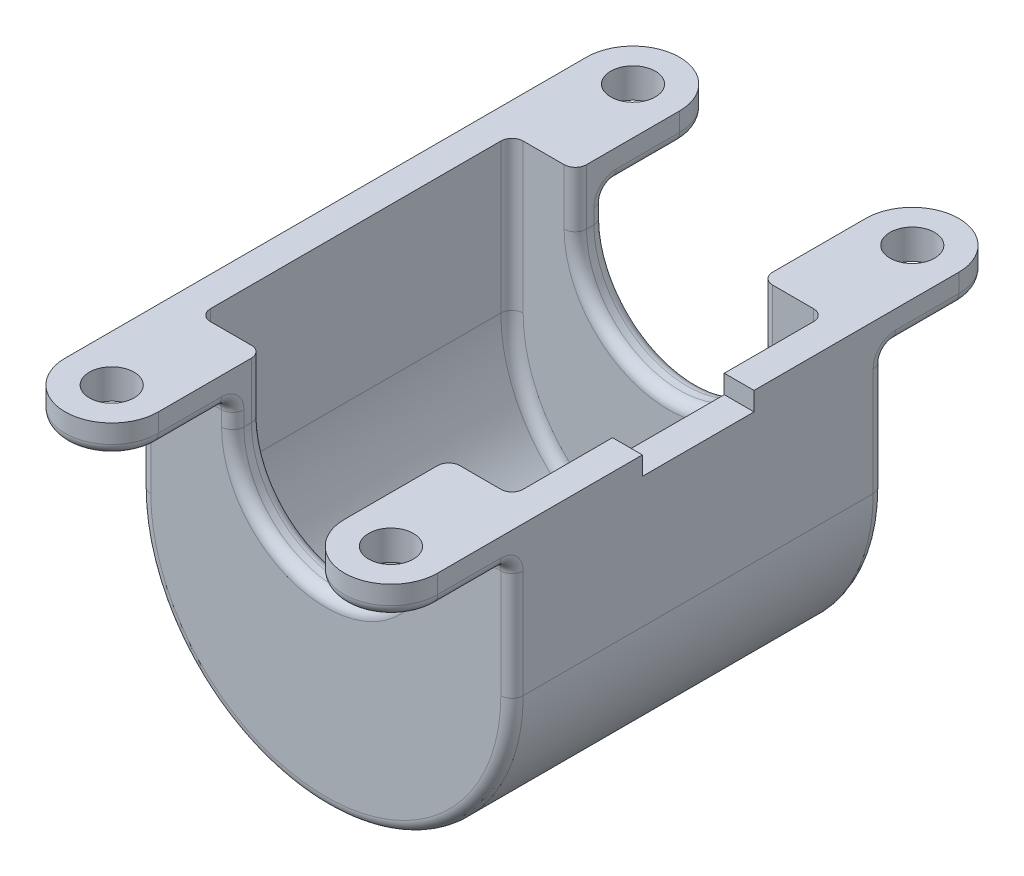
ISO-10303-21;
HEADER;
FILE_DESCRIPTION(('STEP AP214'),'2;1');
FILE_NAME('part.step','',(''),(''),'','','');
FILE_SCHEMA(('AUTOMOTIVE_DESIGN { 1 0 10303 214 1 1 1 1 }'));
ENDSEC;
DATA;
#1=APPLICATION_CONTEXT('core data for automotive mechanical design processes');
#2=APPLICATION_PROTOCOL_DEFINITION('international standard','automotive_design',2000,#1);
#3=PRODUCT_CONTEXT('',#1,'mechanical');
#4=PRODUCT('Part','Part','',(#3));
#5=PRODUCT_RELATED_PRODUCT_CATEGORY('part','',(#4));
#6=PRODUCT_DEFINITION_FORMATION('','',#4);
#7=PRODUCT_DEFINITION_CONTEXT('part definition',#1,'design');
#8=PRODUCT_DEFINITION('design','',#6,#7);
#9=PRODUCT_DEFINITION_SHAPE('','',#8);
#10=(LENGTH_UNIT() NAMED_UNIT(*) SI_UNIT(.MILLI.,.METRE.));
#11=(NAMED_UNIT(*) PLANE_ANGLE_UNIT() SI_UNIT($,.RADIAN.));
#12=(NAMED_UNIT(*) SI_UNIT($,.STERADIAN.) SOLID_ANGLE_UNIT());
#13=UNCERTAINTY_MEASURE_WITH_UNIT(LENGTH_MEASURE(1.E-05),#10,'distance_accuracy_value','');
#14=(GEOMETRIC_REPRESENTATION_CONTEXT(3) GLOBAL_UNCERTAINTY_ASSIGNED_CONTEXT((#13)) GLOBAL_UNIT_ASSIGNED_CONTEXT((#10,
#11,#12)) REPRESENTATION_CONTEXT('',''));
#15=CARTESIAN_POINT('',(0.,0.,0.));
#16=DIRECTION('',(0.,0.,1.));
#17=DIRECTION('',(1.,0.,0.));
#18=AXIS2_PLACEMENT_3D('',#15,#16,#17);
#19=CARTESIAN_POINT('',(25.,15.,50.));
#20=DIRECTION('',(0.,-1.,0.));
#21=DIRECTION('',(0.,0.,-1.));
#22=AXIS2_PLACEMENT_3D('',#19,#20,#21);
#23=PLANE('',#22);
#24=CARTESIAN_POINT('',(37.5,15.,-70.));
#25=DIRECTION('',(0.,1.,0.));
#26=DIRECTION('',(0.,0.,1.));
#27=AXIS2_PLACEMENT_3D('',#24,#25,#26);
#28=CIRCLE('',#27,5.99999999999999);
#29=CARTESIAN_POINT('',(37.5,15.,-64.));
#30=VERTEX_POINT('',#29);
#31=EDGE_CURVE('E438',#30,#30,#28,.T.);
#32=ORIENTED_EDGE('',*,*,#31,.F.);
#33=EDGE_LOOP('',(#32));
#34=FACE_BOUND('',#33,.T.);
#35=DIRECTION('',(0.,0.,-1.));
#36=VECTOR('',#35,1.);
#37=CARTESIAN_POINT('',(25.,15.,50.));
#38=LINE('',#37,#36);
#39=CARTESIAN_POINT('',(25.,15.,-45.));
#40=VERTEX_POINT('',#39);
#41=CARTESIAN_POINT('',(25.,15.,-70.));
#42=VERTEX_POINT('',#41);
#43=EDGE_CURVE('E514',#40,#42,#38,.T.);
#44=ORIENTED_EDGE('',*,*,#43,.F.);
#45=CARTESIAN_POINT('',(28.,15.,-45.));
#46=DIRECTION('',(0.,-1.,0.));
#47=DIRECTION('',(0.,0.,-1.));
#48=AXIS2_PLACEMENT_3D('',#45,#46,#47);
#49=CIRCLE('',#48,3.);
#50=CARTESIAN_POINT('',(28.,15.,-42.));
#51=VERTEX_POINT('',#50);
#52=EDGE_CURVE('E733',#40,#51,#49,.F.);
#53=ORIENTED_EDGE('',*,*,#52,.T.);
#54=DIRECTION('',(-1.,0.,0.));
#55=VECTOR('',#54,1.);
#56=CARTESIAN_POINT('',(25.,15.,-42.));
#57=LINE('',#56,#55);
#58=CARTESIAN_POINT('',(39.,15.,-42.));
#59=VERTEX_POINT('',#58);
#60=EDGE_CURVE('E493',#59,#51,#57,.T.);
#61=ORIENTED_EDGE('',*,*,#60,.F.);
#62=CARTESIAN_POINT('',(39.,15.,-39.));
#63=DIRECTION('',(0.,-1.,0.));
#64=DIRECTION('',(0.,0.,-1.));
#65=AXIS2_PLACEMENT_3D('',#62,#63,#64);
#66=CIRCLE('',#65,3.);
#67=CARTESIAN_POINT('',(42.,15.,-39.));
#68=VERTEX_POINT('',#67);
#69=EDGE_CURVE('E49',#59,#68,#66,.T.);
#70=ORIENTED_EDGE('',*,*,#69,.T.);
#71=DIRECTION('',(0.,0.,-1.));
#72=VECTOR('',#71,1.);
#73=CARTESIAN_POINT('',(42.,15.,50.));
#74=LINE('',#73,#72);
#75=CARTESIAN_POINT('',(42.,15.,-15.));
#76=VERTEX_POINT('',#75);
#77=EDGE_CURVE('E494',#76,#68,#74,.T.);
#78=ORIENTED_EDGE('',*,*,#77,.F.);
#79=DIRECTION('',(-1.,0.,0.));
#80=VECTOR('',#79,1.);
#81=CARTESIAN_POINT('',(25.,15.,-15.));
#82=LINE('',#81,#80);
#83=CARTESIAN_POINT('',(50.,15.,-15.));
#84=VERTEX_POINT('',#83);
#85=EDGE_CURVE('E421',#84,#76,#82,.T.);
#86=ORIENTED_EDGE('',*,*,#85,.F.);
#87=DIRECTION('',(0.,0.,-1.));
#88=VECTOR('',#87,1.);
#89=CARTESIAN_POINT('',(50.,15.,50.));
#90=LINE('',#89,#88);
#91=CARTESIAN_POINT('',(50.,15.,-70.));
#92=VERTEX_POINT('',#91);
#93=EDGE_CURVE('E423',#84,#92,#90,.T.);
#94=ORIENTED_EDGE('',*,*,#93,.T.);
#95=CARTESIAN_POINT('',(37.5,15.,-70.));
#96=DIRECTION('',(0.,1.,0.));
#97=DIRECTION('',(1.,0.,0.));
#98=AXIS2_PLACEMENT_3D('',#95,#96,#97);
#99=CIRCLE('',#98,12.5);
#100=EDGE_CURVE('E443',#92,#42,#99,.T.);
#101=ORIENTED_EDGE('',*,*,#100,.T.);
#102=EDGE_LOOP('',(#44,#53,#61,#70,#78,#86,#94,#101));
#103=FACE_BOUND('',#102,.T.);
#104=ADVANCED_FACE('F41',(#34,#103),#23,.F.);
#105=CARTESIAN_POINT('',(37.5,15.,70.));
#106=DIRECTION('',(0.,1.,0.));
#107=DIRECTION('',(0.,0.,1.));
#108=AXIS2_PLACEMENT_3D('',#105,#106,#107);
#109=CIRCLE('',#108,5.99999999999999);
#110=CARTESIAN_POINT('',(37.5,15.,76.));
#111=VERTEX_POINT('',#110);
#112=EDGE_CURVE('E448',#111,#111,#109,.T.);
#113=ORIENTED_EDGE('',*,*,#112,.F.);
#114=EDGE_LOOP('',(#113));
#115=FACE_BOUND('',#114,.T.);
#116=DIRECTION('',(-1.,0.,0.));
#117=VECTOR('',#116,1.);
#118=CARTESIAN_POINT('',(25.,15.,42.));
#119=LINE('',#118,#117);
#120=CARTESIAN_POINT('',(39.,15.,42.));
#121=VERTEX_POINT('',#120);
#122=CARTESIAN_POINT('',(28.,15.,42.));
#123=VERTEX_POINT('',#122);
#124=EDGE_CURVE('E489',#121,#123,#119,.T.);
#125=ORIENTED_EDGE('',*,*,#124,.T.);
#126=CARTESIAN_POINT('',(28.,15.,45.));
#127=DIRECTION('',(0.,-1.,0.));
#128=DIRECTION('',(0.,0.,-1.));
#129=AXIS2_PLACEMENT_3D('',#126,#127,#128);
#130=CIRCLE('',#129,3.);
#131=CARTESIAN_POINT('',(25.,15.,45.));
#132=VERTEX_POINT('',#131);
#133=EDGE_CURVE('E742',#123,#132,#130,.F.);
#134=ORIENTED_EDGE('',*,*,#133,.T.);
#135=CARTESIAN_POINT('',(25.,15.,70.));
#136=VERTEX_POINT('',#135);
#137=EDGE_CURVE('E509',#136,#132,#38,.T.);
#138=ORIENTED_EDGE('',*,*,#137,.F.);
#139=CARTESIAN_POINT('',(37.5,15.,70.));
#140=DIRECTION('',(0.,-1.,0.));
#141=DIRECTION('',(1.,0.,0.));
#142=AXIS2_PLACEMENT_3D('',#139,#140,#141);
#143=CIRCLE('',#142,12.5);
#144=CARTESIAN_POINT('',(50.,15.,70.));
#145=VERTEX_POINT('',#144);
#146=EDGE_CURVE('E459',#145,#136,#143,.T.);
#147=ORIENTED_EDGE('',*,*,#146,.F.);
#148=CARTESIAN_POINT('',(50.,15.,15.));
#149=VERTEX_POINT('',#148);
#150=EDGE_CURVE('E511',#145,#149,#90,.T.);
#151=ORIENTED_EDGE('',*,*,#150,.T.);
#152=DIRECTION('',(1.,0.,0.));
#153=VECTOR('',#152,1.);
#154=CARTESIAN_POINT('',(25.,15.,15.));
#155=LINE('',#154,#153);
#156=CARTESIAN_POINT('',(42.,15.,15.));
#157=VERTEX_POINT('',#156);
#158=EDGE_CURVE('E407',#157,#149,#155,.T.);
#159=ORIENTED_EDGE('',*,*,#158,.F.);
#160=CARTESIAN_POINT('',(42.,15.,39.));
#161=VERTEX_POINT('',#160);
#162=EDGE_CURVE('E483',#161,#157,#74,.T.);
#163=ORIENTED_EDGE('',*,*,#162,.F.);
#164=CARTESIAN_POINT('',(39.,15.,39.));
#165=DIRECTION('',(0.,-1.,0.));
#166=DIRECTION('',(0.,0.,-1.));
#167=AXIS2_PLACEMENT_3D('',#164,#165,#166);
#168=CIRCLE('',#167,3.);
#169=EDGE_CURVE('E751',#161,#121,#168,.T.);
#170=ORIENTED_EDGE('',*,*,#169,.T.);
#171=EDGE_LOOP('',(#125,#134,#138,#147,#151,#159,#163,#170));
#172=FACE_BOUND('',#171,.T.);
#173=ADVANCED_FACE('F1100',(#115,#172),#23,.F.);
#174=CARTESIAN_POINT('',(50.,15.,50.));
#175=DIRECTION('',(-1.,0.,0.));
#176=DIRECTION('',(0.,0.,1.));
#177=AXIS2_PLACEMENT_3D('',#174,#175,#176);
#178=PLANE('',#177);
#179=DIRECTION('',(0.,1.,0.));
#180=VECTOR('',#179,1.);
#181=CARTESIAN_POINT('',(50.,7.,70.));
#182=LINE('',#181,#180);
#183=CARTESIAN_POINT('',(50.,10.,70.));
#184=VERTEX_POINT('',#183);
#185=EDGE_CURVE('E461',#184,#145,#182,.T.);
#186=ORIENTED_EDGE('',*,*,#185,.F.);
#187=DIRECTION('',(0.,0.,1.));
#188=VECTOR('',#187,1.);
#189=CARTESIAN_POINT('',(50.,10.,50.));
#190=LINE('',#189,#188);
#191=CARTESIAN_POINT('',(50.,10.,53.));
#192=VERTEX_POINT('',#191);
#193=EDGE_CURVE('E607',#184,#192,#190,.F.);
#194=ORIENTED_EDGE('',*,*,#193,.T.);
#195=CARTESIAN_POINT('',(50.,4.,53.));
#196=DIRECTION('',(-1.,0.,0.));
#197=DIRECTION('',(0.,0.,1.));
#198=AXIS2_PLACEMENT_3D('',#195,#196,#197);
#199=CIRCLE('',#198,6.);
#200=CARTESIAN_POINT('',(50.,4.,47.));
#201=VERTEX_POINT('',#200);
#202=EDGE_CURVE('E603',#192,#201,#199,.T.);
#203=ORIENTED_EDGE('',*,*,#202,.T.);
#204=DIRECTION('',(0.,1.,0.));
#205=VECTOR('',#204,1.);
#206=CARTESIAN_POINT('',(50.,-25.,47.));
#207=LINE('',#206,#205);
#208=CARTESIAN_POINT('',(50.,-25.,47.));
#209=VERTEX_POINT('',#208);
#210=EDGE_CURVE('E604',#201,#209,#207,.F.);
#211=ORIENTED_EDGE('',*,*,#210,.T.);
#212=DIRECTION('',(0.,0.,-1.));
#213=VECTOR('',#212,1.);
#214=CARTESIAN_POINT('',(50.,-25.,50.));
#215=LINE('',#214,#213);
#216=CARTESIAN_POINT('',(50.,-25.,-47.));
#217=VERTEX_POINT('',#216);
#218=EDGE_CURVE('E520',#209,#217,#215,.T.);
#219=ORIENTED_EDGE('',*,*,#218,.T.);
#220=DIRECTION('',(0.,1.,0.));
#221=VECTOR('',#220,1.);
#222=CARTESIAN_POINT('',(50.,15.,-47.));
#223=LINE('',#222,#221);
#224=CARTESIAN_POINT('',(50.,4.,-47.));
#225=VERTEX_POINT('',#224);
#226=EDGE_CURVE('E600',#217,#225,#223,.T.);
#227=ORIENTED_EDGE('',*,*,#226,.T.);
#228=CARTESIAN_POINT('',(50.,4.,-53.));
#229=DIRECTION('',(-1.,0.,0.));
#230=DIRECTION('',(0.,0.,1.));
#231=AXIS2_PLACEMENT_3D('',#228,#229,#230);
#232=CIRCLE('',#231,6.);
#233=CARTESIAN_POINT('',(50.,10.,-53.));
#234=VERTEX_POINT('',#233);
#235=EDGE_CURVE('E599',#225,#234,#232,.T.);
#236=ORIENTED_EDGE('',*,*,#235,.T.);
#237=DIRECTION('',(0.,0.,-1.));
#238=VECTOR('',#237,1.);
#239=CARTESIAN_POINT('',(50.,10.,50.));
#240=LINE('',#239,#238);
#241=CARTESIAN_POINT('',(50.,10.,-70.));
#242=VERTEX_POINT('',#241);
#243=EDGE_CURVE('E602',#234,#242,#240,.T.);
#244=ORIENTED_EDGE('',*,*,#243,.T.);
#245=DIRECTION('',(0.,1.,0.));
#246=VECTOR('',#245,1.);
#247=CARTESIAN_POINT('',(50.,7.,-70.));
#248=LINE('',#247,#246);
#249=EDGE_CURVE('E450',#242,#92,#248,.T.);
#250=ORIENTED_EDGE('',*,*,#249,.T.);
#251=ORIENTED_EDGE('',*,*,#93,.F.);
#252=DIRECTION('',(0.,1.,0.));
#253=VECTOR('',#252,1.);
#254=CARTESIAN_POINT('',(50.,15.,-15.));
#255=LINE('',#254,#253);
#256=CARTESIAN_POINT('',(50.,10.,-15.));
#257=VERTEX_POINT('',#256);
#258=EDGE_CURVE('E408',#257,#84,#255,.T.);
#259=ORIENTED_EDGE('',*,*,#258,.F.);
#260=DIRECTION('',(0.,0.,-1.));
#261=VECTOR('',#260,1.);
#262=CARTESIAN_POINT('',(50.,10.,50.));
#263=LINE('',#262,#261);
#264=CARTESIAN_POINT('',(50.,10.,15.));
#265=VERTEX_POINT('',#264);
#266=EDGE_CURVE('E396',#265,#257,#263,.T.);
#267=ORIENTED_EDGE('',*,*,#266,.F.);
#268=DIRECTION('',(0.,-1.,0.));
#269=VECTOR('',#268,1.);
#270=CARTESIAN_POINT('',(50.,15.,15.));
#271=LINE('',#270,#269);
#272=EDGE_CURVE('E426',#149,#265,#271,.T.);
#273=ORIENTED_EDGE('',*,*,#272,.F.);
#274=ORIENTED_EDGE('',*,*,#150,.F.);
#275=EDGE_LOOP('',(#186,#194,#203,#211,#219,#227,#236,#244,#250,#251,#259,#267,#273,#274));
#276=FACE_BOUND('',#275,.T.);
#277=ADVANCED_FACE('F419',(#276),#178,.F.);
#278=CARTESIAN_POINT('',(42.,15.,50.));
#279=DIRECTION('',(-1.,0.,0.));
#280=DIRECTION('',(0.,0.,1.));
#281=AXIS2_PLACEMENT_3D('',#278,#279,#280);
#282=PLANE('',#281);
#283=DIRECTION('',(0.,0.,1.));
#284=VECTOR('',#283,1.);
#285=CARTESIAN_POINT('',(42.,-25.,50.));
#286=LINE('',#285,#284);
#287=CARTESIAN_POINT('',(42.,-25.,39.));
#288=VERTEX_POINT('',#287);
#289=CARTESIAN_POINT('',(42.,-25.,-39.));
#290=VERTEX_POINT('',#289);
#291=EDGE_CURVE('E480',#288,#290,#286,.F.);
#292=ORIENTED_EDGE('',*,*,#291,.F.);
#293=DIRECTION('',(0.,1.,0.));
#294=VECTOR('',#293,1.);
#295=CARTESIAN_POINT('',(42.,15.,39.));
#296=LINE('',#295,#294);
#297=EDGE_CURVE('E720',#288,#161,#296,.T.);
#298=ORIENTED_EDGE('',*,*,#297,.T.);
#299=ORIENTED_EDGE('',*,*,#162,.T.);
#300=DIRECTION('',(0.,-1.,0.));
#301=VECTOR('',#300,1.);
#302=CARTESIAN_POINT('',(42.,15.,15.));
#303=LINE('',#302,#301);
#304=CARTESIAN_POINT('',(42.,10.,15.));
#305=VERTEX_POINT('',#304);
#306=EDGE_CURVE('E534',#157,#305,#303,.T.);
#307=ORIENTED_EDGE('',*,*,#306,.T.);
#308=DIRECTION('',(0.,0.,-1.));
#309=VECTOR('',#308,1.);
#310=CARTESIAN_POINT('',(42.,10.,50.));
#311=LINE('',#310,#309);
#312=CARTESIAN_POINT('',(42.,10.,-15.));
#313=VERTEX_POINT('',#312);
#314=EDGE_CURVE('E526',#305,#313,#311,.T.);
#315=ORIENTED_EDGE('',*,*,#314,.T.);
#316=DIRECTION('',(0.,1.,0.));
#317=VECTOR('',#316,1.);
#318=CARTESIAN_POINT('',(42.,15.,-15.));
#319=LINE('',#318,#317);
#320=EDGE_CURVE('E414',#313,#76,#319,.T.);
#321=ORIENTED_EDGE('',*,*,#320,.T.);
#322=ORIENTED_EDGE('',*,*,#77,.T.);
#323=DIRECTION('',(0.,1.,0.));
#324=VECTOR('',#323,1.);
#325=CARTESIAN_POINT('',(42.,-25.,-39.));
#326=LINE('',#325,#324);
#327=EDGE_CURVE('E717',#68,#290,#326,.F.);
#328=ORIENTED_EDGE('',*,*,#327,.T.);
#329=EDGE_LOOP('',(#292,#298,#299,#307,#315,#321,#322,#328));
#330=FACE_BOUND('',#329,.T.);
#331=ADVANCED_FACE('F1111',(#330),#282,.T.);
#332=CARTESIAN_POINT('',(0.,-25.,-50.));
#333=DIRECTION('',(0.,0.,1.));
#334=DIRECTION('',(1.,0.,0.));
#335=AXIS2_PLACEMENT_3D('',#332,#333,#334);
#336=PLANE('',#335);
#337=DIRECTION('',(1.,0.,0.));
#338=VECTOR('',#337,1.);
#339=CARTESIAN_POINT('',(50.,4.,-50.));
#340=LINE('',#339,#338);
#341=CARTESIAN_POINT('',(28.,3.99999999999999,-50.));
#342=VERTEX_POINT('',#341);
#343=CARTESIAN_POINT('',(47.,4.,-50.));
#344=VERTEX_POINT('',#343);
#345=EDGE_CURVE('E541',#342,#344,#340,.T.);
#346=ORIENTED_EDGE('',*,*,#345,.T.);
#347=DIRECTION('',(0.,1.,0.));
#348=VECTOR('',#347,1.);
#349=CARTESIAN_POINT('',(47.,-25.,-50.));
#350=LINE('',#349,#348);
#351=CARTESIAN_POINT('',(47.,-25.,-50.));
#352=VERTEX_POINT('',#351);
#353=EDGE_CURVE('E663',#344,#352,#350,.F.);
#354=ORIENTED_EDGE('',*,*,#353,.T.);
#355=CARTESIAN_POINT('',(0.,-25.,-50.));
#356=DIRECTION('',(0.,0.,1.));
#357=DIRECTION('',(1.,0.,0.));
#358=AXIS2_PLACEMENT_3D('',#355,#356,#357);
#359=CIRCLE('',#358,47.);
#360=CARTESIAN_POINT('',(-47.,-25.,-50.));
#361=VERTEX_POINT('',#360);
#362=EDGE_CURVE('E661',#352,#361,#359,.F.);
#363=ORIENTED_EDGE('',*,*,#362,.T.);
#364=DIRECTION('',(0.,-1.,0.));
#365=VECTOR('',#364,1.);
#366=CARTESIAN_POINT('',(-47.,-25.,-50.));
#367=LINE('',#366,#365);
#368=CARTESIAN_POINT('',(-47.,4.,-50.));
#369=VERTEX_POINT('',#368);
#370=EDGE_CURVE('E662',#361,#369,#367,.F.);
#371=ORIENTED_EDGE('',*,*,#370,.T.);
#372=DIRECTION('',(-1.,0.,0.));
#373=VECTOR('',#372,1.);
#374=CARTESIAN_POINT('',(-25.,3.99999999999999,-50.));
#375=LINE('',#374,#373);
#376=CARTESIAN_POINT('',(-28.,3.99999999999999,-50.));
#377=VERTEX_POINT('',#376);
#378=EDGE_CURVE('E543',#369,#377,#375,.F.);
#379=ORIENTED_EDGE('',*,*,#378,.T.);
#380=DIRECTION('',(0.,1.,0.));
#381=VECTOR('',#380,1.);
#382=CARTESIAN_POINT('',(-28.,-25.,-50.));
#383=LINE('',#382,#381);
#384=CARTESIAN_POINT('',(-28.,0.,-50.));
#385=VERTEX_POINT('',#384);
#386=EDGE_CURVE('E656',#377,#385,#383,.F.);
#387=ORIENTED_EDGE('',*,*,#386,.T.);
#388=CARTESIAN_POINT('',(0.,0.,-50.));
#389=DIRECTION('',(0.,0.,1.));
#390=DIRECTION('',(1.,0.,0.));
#391=AXIS2_PLACEMENT_3D('',#388,#389,#390);
#392=CIRCLE('',#391,28.);
#393=CARTESIAN_POINT('',(28.,0.,-50.));
#394=VERTEX_POINT('',#393);
#395=EDGE_CURVE('E651',#385,#394,#392,.T.);
#396=ORIENTED_EDGE('',*,*,#395,.T.);
#397=DIRECTION('',(0.,-1.,0.));
#398=VECTOR('',#397,1.);
#399=CARTESIAN_POINT('',(28.,-25.,-50.));
#400=LINE('',#399,#398);
#401=EDGE_CURVE('E657',#394,#342,#400,.F.);
#402=ORIENTED_EDGE('',*,*,#401,.T.);
#403=EDGE_LOOP('',(#346,#354,#363,#371,#379,#387,#396,#402));
#404=FACE_BOUND('',#403,.T.);
#405=ADVANCED_FACE('F1135',(#404),#336,.F.);
#406=CARTESIAN_POINT('',(0.,-25.,50.));
#407=DIRECTION('',(0.,0.,1.));
#408=DIRECTION('',(1.,0.,0.));
#409=AXIS2_PLACEMENT_3D('',#406,#407,#408);
#410=PLANE('',#409);
#411=CARTESIAN_POINT('',(0.,-25.,50.));
#412=DIRECTION('',(0.,0.,1.));
#413=DIRECTION('',(1.,0.,0.));
#414=AXIS2_PLACEMENT_3D('',#411,#412,#413);
#415=CIRCLE('',#414,47.);
#416=CARTESIAN_POINT('',(-47.,-25.,50.));
#417=VERTEX_POINT('',#416);
#418=CARTESIAN_POINT('',(47.,-25.,50.));
#419=VERTEX_POINT('',#418);
#420=EDGE_CURVE('E571',#417,#419,#415,.T.);
#421=ORIENTED_EDGE('',*,*,#420,.T.);
#422=DIRECTION('',(0.,1.,0.));
#423=VECTOR('',#422,1.);
#424=CARTESIAN_POINT('',(47.,4.,50.));
#425=LINE('',#424,#423);
#426=CARTESIAN_POINT('',(47.,4.,50.));
#427=VERTEX_POINT('',#426);
#428=EDGE_CURVE('E572',#419,#427,#425,.T.);
#429=ORIENTED_EDGE('',*,*,#428,.T.);
#430=DIRECTION('',(1.,0.,0.));
#431=VECTOR('',#430,1.);
#432=CARTESIAN_POINT('',(0.,3.99999999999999,50.));
#433=LINE('',#432,#431);
#434=CARTESIAN_POINT('',(28.,3.99999999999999,50.));
#435=VERTEX_POINT('',#434);
#436=EDGE_CURVE('E558',#427,#435,#433,.F.);
#437=ORIENTED_EDGE('',*,*,#436,.T.);
#438=DIRECTION('',(0.,-1.,0.));
#439=VECTOR('',#438,1.);
#440=CARTESIAN_POINT('',(28.,0.,50.));
#441=LINE('',#440,#439);
#442=CARTESIAN_POINT('',(28.,0.,50.));
#443=VERTEX_POINT('',#442);
#444=EDGE_CURVE('E566',#435,#443,#441,.T.);
#445=ORIENTED_EDGE('',*,*,#444,.T.);
#446=CARTESIAN_POINT('',(0.,0.,50.));
#447=DIRECTION('',(0.,0.,1.));
#448=DIRECTION('',(1.,0.,0.));
#449=AXIS2_PLACEMENT_3D('',#446,#447,#448);
#450=CIRCLE('',#449,28.);
#451=CARTESIAN_POINT('',(-28.,0.,50.));
#452=VERTEX_POINT('',#451);
#453=EDGE_CURVE('E565',#443,#452,#450,.F.);
#454=ORIENTED_EDGE('',*,*,#453,.T.);
#455=DIRECTION('',(0.,1.,0.));
#456=VECTOR('',#455,1.);
#457=CARTESIAN_POINT('',(-28.,4.,50.));
#458=LINE('',#457,#456);
#459=CARTESIAN_POINT('',(-28.,3.99999999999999,50.));
#460=VERTEX_POINT('',#459);
#461=EDGE_CURVE('E562',#452,#460,#458,.T.);
#462=ORIENTED_EDGE('',*,*,#461,.T.);
#463=DIRECTION('',(-1.,0.,0.));
#464=VECTOR('',#463,1.);
#465=CARTESIAN_POINT('',(0.,3.99999999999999,50.));
#466=LINE('',#465,#464);
#467=CARTESIAN_POINT('',(-47.,4.,50.));
#468=VERTEX_POINT('',#467);
#469=EDGE_CURVE('E551',#460,#468,#466,.T.);
#470=ORIENTED_EDGE('',*,*,#469,.T.);
#471=DIRECTION('',(0.,-1.,0.));
#472=VECTOR('',#471,1.);
#473=CARTESIAN_POINT('',(-47.,-25.,50.));
#474=LINE('',#473,#472);
#475=EDGE_CURVE('E567',#468,#417,#474,.T.);
#476=ORIENTED_EDGE('',*,*,#475,.T.);
#477=EDGE_LOOP('',(#421,#429,#437,#445,#454,#462,#470,#476));
#478=FACE_BOUND('',#477,.T.);
#479=ADVANCED_FACE('F1061',(#478),#410,.T.);
#480=CARTESIAN_POINT('',(-25.,15.,50.));
#481=DIRECTION('',(0.,-1.,0.));
#482=DIRECTION('',(1.,0.,0.));
#483=AXIS2_PLACEMENT_3D('',#480,#481,#482);
#484=PLANE('',#483);
#485=CARTESIAN_POINT('',(-37.5,15.,-70.));
#486=DIRECTION('',(0.,1.,0.));
#487=DIRECTION('',(0.,0.,1.));
#488=AXIS2_PLACEMENT_3D('',#485,#486,#487);
#489=CIRCLE('',#488,5.99999999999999);
#490=CARTESIAN_POINT('',(-37.5,15.,-64.));
#491=VERTEX_POINT('',#490);
#492=EDGE_CURVE('E422',#491,#491,#489,.T.);
#493=ORIENTED_EDGE('',*,*,#492,.F.);
#494=EDGE_LOOP('',(#493));
#495=FACE_BOUND('',#494,.T.);
#496=CARTESIAN_POINT('',(-37.5,15.,70.));
#497=DIRECTION('',(0.,1.,0.));
#498=DIRECTION('',(0.,0.,1.));
#499=AXIS2_PLACEMENT_3D('',#496,#497,#498);
#500=CIRCLE('',#499,5.99999999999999);
#501=CARTESIAN_POINT('',(-37.5,15.,76.));
#502=VERTEX_POINT('',#501);
#503=EDGE_CURVE('E462',#502,#502,#500,.T.);
#504=ORIENTED_EDGE('',*,*,#503,.F.);
#505=EDGE_LOOP('',(#504));
#506=FACE_BOUND('',#505,.T.);
#507=DIRECTION('',(-1.,0.,0.));
#508=VECTOR('',#507,1.);
#509=CARTESIAN_POINT('',(-25.,15.,-42.));
#510=LINE('',#509,#508);
#511=CARTESIAN_POINT('',(-28.,15.,-42.));
#512=VERTEX_POINT('',#511);
#513=CARTESIAN_POINT('',(-39.,15.,-42.));
#514=VERTEX_POINT('',#513);
#515=EDGE_CURVE('E471',#512,#514,#510,.T.);
#516=ORIENTED_EDGE('',*,*,#515,.F.);
#517=CARTESIAN_POINT('',(-28.,15.,-45.));
#518=DIRECTION('',(0.,-1.,0.));
#519=DIRECTION('',(1.,0.,0.));
#520=AXIS2_PLACEMENT_3D('',#517,#518,#519);
#521=CIRCLE('',#520,3.);
#522=CARTESIAN_POINT('',(-25.,15.,-45.));
#523=VERTEX_POINT('',#522);
#524=EDGE_CURVE('E738',#512,#523,#521,.F.);
#525=ORIENTED_EDGE('',*,*,#524,.T.);
#526=DIRECTION('',(0.,0.,-1.));
#527=VECTOR('',#526,1.);
#528=CARTESIAN_POINT('',(-25.,15.,50.));
#529=LINE('',#528,#527);
#530=CARTESIAN_POINT('',(-25.,15.,-70.));
#531=VERTEX_POINT('',#530);
#532=EDGE_CURVE('E488',#523,#531,#529,.T.);
#533=ORIENTED_EDGE('',*,*,#532,.T.);
#534=CARTESIAN_POINT('',(-37.5,15.,-70.));
#535=DIRECTION('',(0.,-1.,0.));
#536=DIRECTION('',(-1.,0.,0.));
#537=AXIS2_PLACEMENT_3D('',#534,#535,#536);
#538=CIRCLE('',#537,12.5);
#539=CARTESIAN_POINT('',(-50.,15.,-70.));
#540=VERTEX_POINT('',#539);
#541=EDGE_CURVE('E435',#540,#531,#538,.T.);
#542=ORIENTED_EDGE('',*,*,#541,.F.);
#543=DIRECTION('',(0.,0.,-1.));
#544=VECTOR('',#543,1.);
#545=CARTESIAN_POINT('',(-50.,15.,50.));
#546=LINE('',#545,#544);
#547=CARTESIAN_POINT('',(-50.,15.,70.));
#548=VERTEX_POINT('',#547);
#549=EDGE_CURVE('E525',#548,#540,#546,.T.);
#550=ORIENTED_EDGE('',*,*,#549,.F.);
#551=CARTESIAN_POINT('',(-37.5,15.,70.));
#552=DIRECTION('',(0.,1.,0.));
#553=DIRECTION('',(-1.,0.,0.));
#554=AXIS2_PLACEMENT_3D('',#551,#552,#553);
#555=CIRCLE('',#554,12.5);
#556=CARTESIAN_POINT('',(-25.,15.,70.));
#557=VERTEX_POINT('',#556);
#558=EDGE_CURVE('E466',#548,#557,#555,.T.);
#559=ORIENTED_EDGE('',*,*,#558,.T.);
#560=CARTESIAN_POINT('',(-25.,15.,45.));
#561=VERTEX_POINT('',#560);
#562=EDGE_CURVE('E497',#557,#561,#529,.T.);
#563=ORIENTED_EDGE('',*,*,#562,.T.);
#564=CARTESIAN_POINT('',(-28.,15.,45.));
#565=DIRECTION('',(0.,-1.,0.));
#566=DIRECTION('',(1.,0.,0.));
#567=AXIS2_PLACEMENT_3D('',#564,#565,#566);
#568=CIRCLE('',#567,3.);
#569=CARTESIAN_POINT('',(-28.,15.,42.));
#570=VERTEX_POINT('',#569);
#571=EDGE_CURVE('E737',#561,#570,#568,.F.);
#572=ORIENTED_EDGE('',*,*,#571,.T.);
#573=DIRECTION('',(-1.,0.,0.));
#574=VECTOR('',#573,1.);
#575=CARTESIAN_POINT('',(-25.,15.,42.));
#576=LINE('',#575,#574);
#577=CARTESIAN_POINT('',(-39.,15.,42.));
#578=VERTEX_POINT('',#577);
#579=EDGE_CURVE('E487',#570,#578,#576,.T.);
#580=ORIENTED_EDGE('',*,*,#579,.T.);
#581=CARTESIAN_POINT('',(-39.,15.,39.));
#582=DIRECTION('',(0.,-1.,0.));
#583=DIRECTION('',(1.,0.,0.));
#584=AXIS2_PLACEMENT_3D('',#581,#582,#583);
#585=CIRCLE('',#584,3.);
#586=CARTESIAN_POINT('',(-42.,15.,39.));
#587=VERTEX_POINT('',#586);
#588=EDGE_CURVE('E753',#578,#587,#585,.T.);
#589=ORIENTED_EDGE('',*,*,#588,.T.);
#590=DIRECTION('',(0.,0.,-1.));
#591=VECTOR('',#590,1.);
#592=CARTESIAN_POINT('',(-42.,15.,50.));
#593=LINE('',#592,#591);
#594=CARTESIAN_POINT('',(-42.,15.,-39.));
#595=VERTEX_POINT('',#594);
#596=EDGE_CURVE('E478',#587,#595,#593,.T.);
#597=ORIENTED_EDGE('',*,*,#596,.T.);
#598=CARTESIAN_POINT('',(-39.,15.,-39.));
#599=DIRECTION('',(0.,-1.,0.));
#600=DIRECTION('',(1.,0.,0.));
#601=AXIS2_PLACEMENT_3D('',#598,#599,#600);
#602=CIRCLE('',#601,3.);
#603=EDGE_CURVE('E11',#595,#514,#602,.T.);
#604=ORIENTED_EDGE('',*,*,#603,.T.);
#605=EDGE_LOOP('',(#516,#525,#533,#542,#550,#559,#563,#572,#580,#589,#597,#604));
#606=FACE_BOUND('',#605,.T.);
#607=ADVANCED_FACE('F882',(#495,#506,#606),#484,.F.);
#608=CARTESIAN_POINT('',(25.,0.,50.));
#609=DIRECTION('',(1.,0.,0.));
#610=DIRECTION('',(0.,0.,-1.));
#611=AXIS2_PLACEMENT_3D('',#608,#609,#610);
#612=PLANE('',#611);
#613=CARTESIAN_POINT('',(25.,3.99999999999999,-53.));
#614=DIRECTION('',(1.,0.,0.));
#615=DIRECTION('',(0.,0.,-1.));
#616=AXIS2_PLACEMENT_3D('',#613,#614,#615);
#617=CIRCLE('',#616,6.);
#618=CARTESIAN_POINT('',(25.,9.99999999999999,-53.));
#619=VERTEX_POINT('',#618);
#620=CARTESIAN_POINT('',(25.,3.99999999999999,-47.));
#621=VERTEX_POINT('',#620);
#622=EDGE_CURVE('E646',#619,#621,#617,.T.);
#623=ORIENTED_EDGE('',*,*,#622,.T.);
#624=DIRECTION('',(0.,-1.,0.));
#625=VECTOR('',#624,1.);
#626=CARTESIAN_POINT('',(25.,0.,-47.));
#627=LINE('',#626,#625);
#628=CARTESIAN_POINT('',(25.,0.,-47.));
#629=VERTEX_POINT('',#628);
#630=EDGE_CURVE('E652',#621,#629,#627,.T.);
#631=ORIENTED_EDGE('',*,*,#630,.T.);
#632=DIRECTION('',(0.,0.,-1.));
#633=VECTOR('',#632,1.);
#634=CARTESIAN_POINT('',(25.,0.,50.));
#635=LINE('',#634,#633);
#636=CARTESIAN_POINT('',(25.,0.,-45.));
#637=VERTEX_POINT('',#636);
#638=EDGE_CURVE('E506',#637,#629,#635,.T.);
#639=ORIENTED_EDGE('',*,*,#638,.F.);
#640=DIRECTION('',(0.,-1.,0.));
#641=VECTOR('',#640,1.);
#642=CARTESIAN_POINT('',(25.,15.,-45.));
#643=LINE('',#642,#641);
#644=EDGE_CURVE('E643',#637,#40,#643,.F.);
#645=ORIENTED_EDGE('',*,*,#644,.T.);
#646=ORIENTED_EDGE('',*,*,#43,.T.);
#647=DIRECTION('',(0.,1.,0.));
#648=VECTOR('',#647,1.);
#649=CARTESIAN_POINT('',(25.,6.99999999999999,-70.));
#650=LINE('',#649,#648);
#651=CARTESIAN_POINT('',(25.,9.99999999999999,-70.));
#652=VERTEX_POINT('',#651);
#653=EDGE_CURVE('E449',#652,#42,#650,.T.);
#654=ORIENTED_EDGE('',*,*,#653,.F.);
#655=DIRECTION('',(0.,0.,1.));
#656=VECTOR('',#655,1.);
#657=CARTESIAN_POINT('',(25.,9.99999999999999,50.));
#658=LINE('',#657,#656);
#659=EDGE_CURVE('E650',#652,#619,#658,.T.);
#660=ORIENTED_EDGE('',*,*,#659,.T.);
#661=EDGE_LOOP('',(#623,#631,#639,#645,#646,#654,#660));
#662=FACE_BOUND('',#661,.T.);
#663=ADVANCED_FACE('F937',(#662),#612,.F.);
#664=CARTESIAN_POINT('',(0.,0.,50.));
#665=DIRECTION('',(0.,0.,-1.));
#666=DIRECTION('',(-1.,0.,0.));
#667=AXIS2_PLACEMENT_3D('',#664,#665,#666);
#668=CYLINDRICAL_SURFACE('',#667,25.);
#669=ORIENTED_EDGE('',*,*,#638,.T.);
#670=CARTESIAN_POINT('',(0.,0.,-47.));
#671=DIRECTION('',(0.,0.,1.));
#672=DIRECTION('',(1.,0.,0.));
#673=AXIS2_PLACEMENT_3D('',#670,#671,#672);
#674=CIRCLE('',#673,25.);
#675=CARTESIAN_POINT('',(-25.,0.,-47.));
#676=VERTEX_POINT('',#675);
#677=EDGE_CURVE('E750',#629,#676,#674,.F.);
#678=ORIENTED_EDGE('',*,*,#677,.T.);
#679=DIRECTION('',(0.,0.,-1.));
#680=VECTOR('',#679,1.);
#681=CARTESIAN_POINT('',(-25.,0.,50.));
#682=LINE('',#681,#680);
#683=CARTESIAN_POINT('',(-25.,0.,-45.));
#684=VERTEX_POINT('',#683);
#685=EDGE_CURVE('E505',#684,#676,#682,.T.);
#686=ORIENTED_EDGE('',*,*,#685,.F.);
#687=CARTESIAN_POINT('',(0.,0.,-45.));
#688=DIRECTION('',(0.,0.,1.));
#689=DIRECTION('',(1.,0.,0.));
#690=AXIS2_PLACEMENT_3D('',#687,#688,#689);
#691=CIRCLE('',#690,25.);
#692=EDGE_CURVE('E747',#684,#637,#691,.T.);
#693=ORIENTED_EDGE('',*,*,#692,.T.);
#694=EDGE_LOOP('',(#669,#678,#686,#693));
#695=FACE_BOUND('',#694,.T.);
#696=ADVANCED_FACE('F974',(#695),#668,.F.);
#697=CARTESIAN_POINT('',(-25.,15.,50.));
#698=DIRECTION('',(-1.,0.,0.));
#699=DIRECTION('',(0.,-1.,0.));
#700=AXIS2_PLACEMENT_3D('',#697,#698,#699);
#701=PLANE('',#700);
#702=CARTESIAN_POINT('',(-25.,3.99999999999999,-53.));
#703=DIRECTION('',(-1.,0.,0.));
#704=DIRECTION('',(0.,-1.,0.));
#705=AXIS2_PLACEMENT_3D('',#702,#703,#704);
#706=CIRCLE('',#705,6.);
#707=CARTESIAN_POINT('',(-25.,3.99999999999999,-47.));
#708=VERTEX_POINT('',#707);
#709=CARTESIAN_POINT('',(-25.,9.99999999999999,-53.));
#710=VERTEX_POINT('',#709);
#711=EDGE_CURVE('E694',#708,#710,#706,.T.);
#712=ORIENTED_EDGE('',*,*,#711,.T.);
#713=DIRECTION('',(0.,0.,1.));
#714=VECTOR('',#713,1.);
#715=CARTESIAN_POINT('',(-25.,9.99999999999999,50.));
#716=LINE('',#715,#714);
#717=CARTESIAN_POINT('',(-25.,9.99999999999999,-70.));
#718=VERTEX_POINT('',#717);
#719=EDGE_CURVE('E700',#710,#718,#716,.F.);
#720=ORIENTED_EDGE('',*,*,#719,.T.);
#721=DIRECTION('',(0.,1.,0.));
#722=VECTOR('',#721,1.);
#723=CARTESIAN_POINT('',(-25.,6.99999999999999,-70.));
#724=LINE('',#723,#722);
#725=EDGE_CURVE('E434',#718,#531,#724,.T.);
#726=ORIENTED_EDGE('',*,*,#725,.T.);
#727=ORIENTED_EDGE('',*,*,#532,.F.);
#728=DIRECTION('',(0.,1.,0.));
#729=VECTOR('',#728,1.);
#730=CARTESIAN_POINT('',(-25.,0.,-45.));
#731=LINE('',#730,#729);
#732=EDGE_CURVE('E691',#523,#684,#731,.F.);
#733=ORIENTED_EDGE('',*,*,#732,.T.);
#734=ORIENTED_EDGE('',*,*,#685,.T.);
#735=DIRECTION('',(0.,1.,0.));
#736=VECTOR('',#735,1.);
#737=CARTESIAN_POINT('',(-25.,15.,-47.));
#738=LINE('',#737,#736);
#739=EDGE_CURVE('E693',#676,#708,#738,.T.);
#740=ORIENTED_EDGE('',*,*,#739,.T.);
#741=EDGE_LOOP('',(#712,#720,#726,#727,#733,#734,#740));
#742=FACE_BOUND('',#741,.T.);
#743=ADVANCED_FACE('F979',(#742),#701,.F.);
#744=CARTESIAN_POINT('',(-50.,15.,50.));
#745=DIRECTION('',(1.,0.,0.));
#746=DIRECTION('',(0.,0.,-1.));
#747=AXIS2_PLACEMENT_3D('',#744,#745,#746);
#748=PLANE('',#747);
#749=DIRECTION('',(0.,0.,-1.));
#750=VECTOR('',#749,1.);
#751=CARTESIAN_POINT('',(-50.,-25.,50.));
#752=LINE('',#751,#750);
#753=CARTESIAN_POINT('',(-50.,-25.,47.));
#754=VERTEX_POINT('',#753);
#755=CARTESIAN_POINT('',(-50.,-25.,-47.));
#756=VERTEX_POINT('',#755);
#757=EDGE_CURVE('E518',#754,#756,#752,.T.);
#758=ORIENTED_EDGE('',*,*,#757,.F.);
#759=DIRECTION('',(0.,-1.,0.));
#760=VECTOR('',#759,1.);
#761=CARTESIAN_POINT('',(-50.,4.,47.));
#762=LINE('',#761,#760);
#763=CARTESIAN_POINT('',(-50.,4.,47.));
#764=VERTEX_POINT('',#763);
#765=EDGE_CURVE('E621',#754,#764,#762,.F.);
#766=ORIENTED_EDGE('',*,*,#765,.T.);
#767=CARTESIAN_POINT('',(-50.,4.,53.));
#768=DIRECTION('',(1.,0.,0.));
#769=DIRECTION('',(0.,0.,-1.));
#770=AXIS2_PLACEMENT_3D('',#767,#768,#769);
#771=CIRCLE('',#770,6.);
#772=CARTESIAN_POINT('',(-50.,10.,53.));
#773=VERTEX_POINT('',#772);
#774=EDGE_CURVE('E623',#764,#773,#771,.T.);
#775=ORIENTED_EDGE('',*,*,#774,.T.);
#776=DIRECTION('',(0.,0.,1.));
#777=VECTOR('',#776,1.);
#778=CARTESIAN_POINT('',(-50.,10.,50.));
#779=LINE('',#778,#777);
#780=CARTESIAN_POINT('',(-50.,10.,70.));
#781=VERTEX_POINT('',#780);
#782=EDGE_CURVE('E620',#773,#781,#779,.T.);
#783=ORIENTED_EDGE('',*,*,#782,.T.);
#784=DIRECTION('',(0.,1.,0.));
#785=VECTOR('',#784,1.);
#786=CARTESIAN_POINT('',(-50.,7.,70.));
#787=LINE('',#786,#785);
#788=EDGE_CURVE('E472',#781,#548,#787,.T.);
#789=ORIENTED_EDGE('',*,*,#788,.T.);
#790=ORIENTED_EDGE('',*,*,#549,.T.);
#791=DIRECTION('',(0.,1.,0.));
#792=VECTOR('',#791,1.);
#793=CARTESIAN_POINT('',(-50.,7.,-70.));
#794=LINE('',#793,#792);
#795=CARTESIAN_POINT('',(-50.,10.,-70.));
#796=VERTEX_POINT('',#795);
#797=EDGE_CURVE('E436',#796,#540,#794,.T.);
#798=ORIENTED_EDGE('',*,*,#797,.F.);
#799=DIRECTION('',(0.,0.,-1.));
#800=VECTOR('',#799,1.);
#801=CARTESIAN_POINT('',(-50.,10.,50.));
#802=LINE('',#801,#800);
#803=CARTESIAN_POINT('',(-50.,10.,-53.));
#804=VERTEX_POINT('',#803);
#805=EDGE_CURVE('E613',#796,#804,#802,.F.);
#806=ORIENTED_EDGE('',*,*,#805,.T.);
#807=CARTESIAN_POINT('',(-50.,4.,-53.));
#808=DIRECTION('',(1.,0.,0.));
#809=DIRECTION('',(0.,0.,-1.));
#810=AXIS2_PLACEMENT_3D('',#807,#808,#809);
#811=CIRCLE('',#810,6.);
#812=CARTESIAN_POINT('',(-50.,4.,-47.));
#813=VERTEX_POINT('',#812);
#814=EDGE_CURVE('E611',#804,#813,#811,.T.);
#815=ORIENTED_EDGE('',*,*,#814,.T.);
#816=DIRECTION('',(0.,-1.,0.));
#817=VECTOR('',#816,1.);
#818=CARTESIAN_POINT('',(-50.,15.,-47.));
#819=LINE('',#818,#817);
#820=EDGE_CURVE('E617',#813,#756,#819,.T.);
#821=ORIENTED_EDGE('',*,*,#820,.T.);
#822=EDGE_LOOP('',(#758,#766,#775,#783,#789,#790,#798,#806,#815,#821));
#823=FACE_BOUND('',#822,.T.);
#824=ADVANCED_FACE('F1008',(#823),#748,.F.);
#825=CARTESIAN_POINT('',(0.,-25.,50.));
#826=DIRECTION('',(0.,0.,-1.));
#827=DIRECTION('',(-1.,0.,0.));
#828=AXIS2_PLACEMENT_3D('',#825,#826,#827);
#829=CYLINDRICAL_SURFACE('',#828,50.);
#830=ORIENTED_EDGE('',*,*,#218,.F.);
#831=CARTESIAN_POINT('',(0.,-25.,47.));
#832=DIRECTION('',(0.,0.,1.));
#833=DIRECTION('',(1.,0.,0.));
#834=AXIS2_PLACEMENT_3D('',#831,#832,#833);
#835=CIRCLE('',#834,50.);
#836=EDGE_CURVE('E612',#209,#754,#835,.F.);
#837=ORIENTED_EDGE('',*,*,#836,.T.);
#838=ORIENTED_EDGE('',*,*,#757,.T.);
#839=CARTESIAN_POINT('',(0.,-25.,-47.));
#840=DIRECTION('',(0.,0.,1.));
#841=DIRECTION('',(1.,0.,0.));
#842=AXIS2_PLACEMENT_3D('',#839,#840,#841);
#843=CIRCLE('',#842,50.);
#844=EDGE_CURVE('E608',#756,#217,#843,.T.);
#845=ORIENTED_EDGE('',*,*,#844,.T.);
#846=EDGE_LOOP('',(#830,#837,#838,#845));
#847=FACE_BOUND('',#846,.T.);
#848=ADVANCED_FACE('F1028',(#847),#829,.T.);
#849=CARTESIAN_POINT('',(25.,0.,47.));
#850=VERTEX_POINT('',#849);
#851=CARTESIAN_POINT('',(25.,0.,45.));
#852=VERTEX_POINT('',#851);
#853=EDGE_CURVE('E508',#850,#852,#635,.T.);
#854=ORIENTED_EDGE('',*,*,#853,.F.);
#855=DIRECTION('',(0.,-1.,0.));
#856=VECTOR('',#855,1.);
#857=CARTESIAN_POINT('',(25.,3.99999999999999,47.));
#858=LINE('',#857,#856);
#859=CARTESIAN_POINT('',(25.,3.99999999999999,47.));
#860=VERTEX_POINT('',#859);
#861=EDGE_CURVE('E585',#850,#860,#858,.F.);
#862=ORIENTED_EDGE('',*,*,#861,.T.);
#863=CARTESIAN_POINT('',(25.,3.99999999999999,53.));
#864=DIRECTION('',(1.,0.,0.));
#865=DIRECTION('',(0.,0.,-1.));
#866=AXIS2_PLACEMENT_3D('',#863,#864,#865);
#867=CIRCLE('',#866,6.);
#868=CARTESIAN_POINT('',(25.,9.99999999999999,53.));
#869=VERTEX_POINT('',#868);
#870=EDGE_CURVE('E578',#860,#869,#867,.T.);
#871=ORIENTED_EDGE('',*,*,#870,.T.);
#872=DIRECTION('',(0.,0.,-1.));
#873=VECTOR('',#872,1.);
#874=CARTESIAN_POINT('',(25.,9.99999999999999,50.));
#875=LINE('',#874,#873);
#876=CARTESIAN_POINT('',(25.,9.99999999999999,70.));
#877=VERTEX_POINT('',#876);
#878=EDGE_CURVE('E579',#869,#877,#875,.F.);
#879=ORIENTED_EDGE('',*,*,#878,.T.);
#880=DIRECTION('',(0.,1.,0.));
#881=VECTOR('',#880,1.);
#882=CARTESIAN_POINT('',(25.,6.99999999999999,70.));
#883=LINE('',#882,#881);
#884=EDGE_CURVE('E458',#877,#136,#883,.T.);
#885=ORIENTED_EDGE('',*,*,#884,.T.);
#886=ORIENTED_EDGE('',*,*,#137,.T.);
#887=DIRECTION('',(0.,-1.,0.));
#888=VECTOR('',#887,1.);
#889=CARTESIAN_POINT('',(25.,0.,45.));
#890=LINE('',#889,#888);
#891=EDGE_CURVE('E574',#132,#852,#890,.T.);
#892=ORIENTED_EDGE('',*,*,#891,.T.);
#893=EDGE_LOOP('',(#854,#862,#871,#879,#885,#886,#892));
#894=FACE_BOUND('',#893,.T.);
#895=ADVANCED_FACE('F928',(#894),#612,.F.);
#896=CARTESIAN_POINT('',(-25.,0.,47.));
#897=VERTEX_POINT('',#896);
#898=CARTESIAN_POINT('',(-25.,0.,45.));
#899=VERTEX_POINT('',#898);
#900=EDGE_CURVE('E504',#897,#899,#682,.T.);
#901=ORIENTED_EDGE('',*,*,#900,.F.);
#902=CARTESIAN_POINT('',(0.,0.,47.));
#903=DIRECTION('',(0.,0.,1.));
#904=DIRECTION('',(1.,0.,0.));
#905=AXIS2_PLACEMENT_3D('',#902,#903,#904);
#906=CIRCLE('',#905,25.);
#907=EDGE_CURVE('E741',#897,#850,#906,.T.);
#908=ORIENTED_EDGE('',*,*,#907,.T.);
#909=ORIENTED_EDGE('',*,*,#853,.T.);
#910=CARTESIAN_POINT('',(0.,0.,45.));
#911=DIRECTION('',(0.,0.,1.));
#912=DIRECTION('',(1.,0.,0.));
#913=AXIS2_PLACEMENT_3D('',#910,#911,#912);
#914=CIRCLE('',#913,25.);
#915=EDGE_CURVE('E743',#852,#899,#914,.F.);
#916=ORIENTED_EDGE('',*,*,#915,.T.);
#917=EDGE_LOOP('',(#901,#908,#909,#916));
#918=FACE_BOUND('',#917,.T.);
#919=ADVANCED_FACE('F915',(#918),#668,.F.);
#920=DIRECTION('',(0.,1.,0.));
#921=VECTOR('',#920,1.);
#922=CARTESIAN_POINT('',(-25.,6.99999999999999,70.));
#923=LINE('',#922,#921);
#924=CARTESIAN_POINT('',(-25.,9.99999999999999,70.));
#925=VERTEX_POINT('',#924);
#926=EDGE_CURVE('E475',#925,#557,#923,.T.);
#927=ORIENTED_EDGE('',*,*,#926,.F.);
#928=DIRECTION('',(0.,0.,-1.));
#929=VECTOR('',#928,1.);
#930=CARTESIAN_POINT('',(-25.,9.99999999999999,50.));
#931=LINE('',#930,#929);
#932=CARTESIAN_POINT('',(-25.,9.99999999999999,53.));
#933=VERTEX_POINT('',#932);
#934=EDGE_CURVE('E644',#925,#933,#931,.T.);
#935=ORIENTED_EDGE('',*,*,#934,.T.);
#936=CARTESIAN_POINT('',(-25.,3.99999999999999,53.));
#937=DIRECTION('',(-1.,0.,0.));
#938=DIRECTION('',(0.,-1.,0.));
#939=AXIS2_PLACEMENT_3D('',#936,#937,#938);
#940=CIRCLE('',#939,6.);
#941=CARTESIAN_POINT('',(-25.,3.99999999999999,47.));
#942=VERTEX_POINT('',#941);
#943=EDGE_CURVE('E642',#933,#942,#940,.T.);
#944=ORIENTED_EDGE('',*,*,#943,.T.);
#945=DIRECTION('',(0.,1.,0.));
#946=VECTOR('',#945,1.);
#947=CARTESIAN_POINT('',(-25.,0.,47.));
#948=LINE('',#947,#946);
#949=EDGE_CURVE('E638',#942,#897,#948,.F.);
#950=ORIENTED_EDGE('',*,*,#949,.T.);
#951=ORIENTED_EDGE('',*,*,#900,.T.);
#952=DIRECTION('',(0.,1.,0.));
#953=VECTOR('',#952,1.);
#954=CARTESIAN_POINT('',(-25.,15.,45.));
#955=LINE('',#954,#953);
#956=EDGE_CURVE('E640',#899,#561,#955,.T.);
#957=ORIENTED_EDGE('',*,*,#956,.T.);
#958=ORIENTED_EDGE('',*,*,#562,.F.);
#959=EDGE_LOOP('',(#927,#935,#944,#950,#951,#957,#958));
#960=FACE_BOUND('',#959,.T.);
#961=ADVANCED_FACE('F883',(#960),#701,.F.);
#962=CARTESIAN_POINT('',(-42.,15.,50.));
#963=DIRECTION('',(1.,0.,0.));
#964=DIRECTION('',(0.,0.,-1.));
#965=AXIS2_PLACEMENT_3D('',#962,#963,#964);
#966=PLANE('',#965);
#967=ORIENTED_EDGE('',*,*,#596,.F.);
#968=DIRECTION('',(0.,-1.,0.));
#969=VECTOR('',#968,1.);
#970=CARTESIAN_POINT('',(-42.,15.,39.));
#971=LINE('',#970,#969);
#972=CARTESIAN_POINT('',(-42.,-25.,39.));
#973=VERTEX_POINT('',#972);
#974=EDGE_CURVE('E701',#587,#973,#971,.T.);
#975=ORIENTED_EDGE('',*,*,#974,.T.);
#976=DIRECTION('',(0.,0.,-1.));
#977=VECTOR('',#976,1.);
#978=CARTESIAN_POINT('',(-42.,-25.,50.));
#979=LINE('',#978,#977);
#980=CARTESIAN_POINT('',(-42.,-25.,-39.));
#981=VERTEX_POINT('',#980);
#982=EDGE_CURVE('E476',#973,#981,#979,.T.);
#983=ORIENTED_EDGE('',*,*,#982,.T.);
#984=DIRECTION('',(0.,-1.,0.));
#985=VECTOR('',#984,1.);
#986=CARTESIAN_POINT('',(-42.,15.,-39.));
#987=LINE('',#986,#985);
#988=EDGE_CURVE('E697',#981,#595,#987,.F.);
#989=ORIENTED_EDGE('',*,*,#988,.T.);
#990=EDGE_LOOP('',(#967,#975,#983,#989));
#991=FACE_BOUND('',#990,.T.);
#992=ADVANCED_FACE('F1179',(#991),#966,.T.);
#993=CARTESIAN_POINT('',(0.,-25.,50.));
#994=DIRECTION('',(0.,0.,-1.));
#995=DIRECTION('',(-1.,0.,0.));
#996=AXIS2_PLACEMENT_3D('',#993,#994,#995);
#997=CYLINDRICAL_SURFACE('',#996,42.);
#998=ORIENTED_EDGE('',*,*,#291,.T.);
#999=CARTESIAN_POINT('',(0.,-25.,-39.));
#1000=DIRECTION('',(0.,0.,1.));
#1001=DIRECTION('',(1.,0.,0.));
#1002=AXIS2_PLACEMENT_3D('',#999,#1000,#1001);
#1003=CIRCLE('',#1002,42.);
#1004=EDGE_CURVE('E734',#290,#981,#1003,.F.);
#1005=ORIENTED_EDGE('',*,*,#1004,.T.);
#1006=ORIENTED_EDGE('',*,*,#982,.F.);
#1007=CARTESIAN_POINT('',(0.,-25.,39.));
#1008=DIRECTION('',(0.,0.,1.));
#1009=DIRECTION('',(1.,0.,0.));
#1010=AXIS2_PLACEMENT_3D('',#1007,#1008,#1009);
#1011=CIRCLE('',#1010,42.);
#1012=EDGE_CURVE('E732',#973,#288,#1011,.T.);
#1013=ORIENTED_EDGE('',*,*,#1012,.T.);
#1014=EDGE_LOOP('',(#998,#1005,#1006,#1013));
#1015=FACE_BOUND('',#1014,.T.);
#1016=ADVANCED_FACE('F1181',(#1015),#997,.F.);
#1017=CARTESIAN_POINT('',(0.,-25.,42.));
#1018=DIRECTION('',(0.,0.,1.));
#1019=DIRECTION('',(1.,0.,0.));
#1020=AXIS2_PLACEMENT_3D('',#1017,#1018,#1019);
#1021=PLANE('',#1020);
#1022=CARTESIAN_POINT('',(0.,-25.,42.));
#1023=DIRECTION('',(0.,0.,1.));
#1024=DIRECTION('',(1.,0.,0.));
#1025=AXIS2_PLACEMENT_3D('',#1022,#1023,#1024);
#1026=CIRCLE('',#1025,39.);
#1027=CARTESIAN_POINT('',(39.,-25.,42.));
#1028=VERTEX_POINT('',#1027);
#1029=CARTESIAN_POINT('',(-39.,-25.,42.));
#1030=VERTEX_POINT('',#1029);
#1031=EDGE_CURVE('E708',#1028,#1030,#1026,.F.);
#1032=ORIENTED_EDGE('',*,*,#1031,.T.);
#1033=DIRECTION('',(0.,-1.,0.));
#1034=VECTOR('',#1033,1.);
#1035=CARTESIAN_POINT('',(-39.,-25.,42.));
#1036=LINE('',#1035,#1034);
#1037=EDGE_CURVE('E711',#1030,#578,#1036,.F.);
#1038=ORIENTED_EDGE('',*,*,#1037,.T.);
#1039=ORIENTED_EDGE('',*,*,#579,.F.);
#1040=DIRECTION('',(0.,1.,0.));
#1041=VECTOR('',#1040,1.);
#1042=CARTESIAN_POINT('',(-28.,-25.,42.));
#1043=LINE('',#1042,#1041);
#1044=CARTESIAN_POINT('',(-28.,0.,42.));
#1045=VERTEX_POINT('',#1044);
#1046=EDGE_CURVE('E707',#570,#1045,#1043,.F.);
#1047=ORIENTED_EDGE('',*,*,#1046,.T.);
#1048=CARTESIAN_POINT('',(0.,0.,42.));
#1049=DIRECTION('',(0.,0.,1.));
#1050=DIRECTION('',(1.,0.,0.));
#1051=AXIS2_PLACEMENT_3D('',#1048,#1049,#1050);
#1052=CIRCLE('',#1051,28.);
#1053=CARTESIAN_POINT('',(28.,0.,42.));
#1054=VERTEX_POINT('',#1053);
#1055=EDGE_CURVE('E703',#1045,#1054,#1052,.T.);
#1056=ORIENTED_EDGE('',*,*,#1055,.T.);
#1057=DIRECTION('',(0.,-1.,0.));
#1058=VECTOR('',#1057,1.);
#1059=CARTESIAN_POINT('',(28.,-25.,42.));
#1060=LINE('',#1059,#1058);
#1061=EDGE_CURVE('E709',#1054,#123,#1060,.F.);
#1062=ORIENTED_EDGE('',*,*,#1061,.T.);
#1063=ORIENTED_EDGE('',*,*,#124,.F.);
#1064=DIRECTION('',(0.,1.,0.));
#1065=VECTOR('',#1064,1.);
#1066=CARTESIAN_POINT('',(39.,-25.,42.));
#1067=LINE('',#1066,#1065);
#1068=EDGE_CURVE('E715',#121,#1028,#1067,.F.);
#1069=ORIENTED_EDGE('',*,*,#1068,.T.);
#1070=EDGE_LOOP('',(#1032,#1038,#1039,#1047,#1056,#1062,#1063,#1069));
#1071=FACE_BOUND('',#1070,.T.);
#1072=ADVANCED_FACE('F1190',(#1071),#1021,.F.);
#1073=CARTESIAN_POINT('',(0.,-25.,-42.));
#1074=DIRECTION('',(0.,0.,1.));
#1075=DIRECTION('',(1.,0.,0.));
#1076=AXIS2_PLACEMENT_3D('',#1073,#1074,#1075);
#1077=PLANE('',#1076);
#1078=CARTESIAN_POINT('',(0.,-25.,-42.));
#1079=DIRECTION('',(0.,0.,1.));
#1080=DIRECTION('',(1.,0.,0.));
#1081=AXIS2_PLACEMENT_3D('',#1078,#1079,#1080);
#1082=CIRCLE('',#1081,39.);
#1083=CARTESIAN_POINT('',(-39.,-25.,-42.));
#1084=VERTEX_POINT('',#1083);
#1085=CARTESIAN_POINT('',(39.,-25.,-42.));
#1086=VERTEX_POINT('',#1085);
#1087=EDGE_CURVE('E59',#1084,#1086,#1082,.T.);
#1088=ORIENTED_EDGE('',*,*,#1087,.T.);
#1089=DIRECTION('',(0.,1.,0.));
#1090=VECTOR('',#1089,1.);
#1091=CARTESIAN_POINT('',(39.,15.,-42.));
#1092=LINE('',#1091,#1090);
#1093=EDGE_CURVE('E729',#1086,#59,#1092,.T.);
#1094=ORIENTED_EDGE('',*,*,#1093,.T.);
#1095=ORIENTED_EDGE('',*,*,#60,.T.);
#1096=DIRECTION('',(0.,-1.,0.));
#1097=VECTOR('',#1096,1.);
#1098=CARTESIAN_POINT('',(28.,0.,-42.));
#1099=LINE('',#1098,#1097);
#1100=CARTESIAN_POINT('',(28.,0.,-42.));
#1101=VERTEX_POINT('',#1100);
#1102=EDGE_CURVE('E723',#51,#1101,#1099,.T.);
#1103=ORIENTED_EDGE('',*,*,#1102,.T.);
#1104=CARTESIAN_POINT('',(0.,0.,-42.));
#1105=DIRECTION('',(0.,0.,1.));
#1106=DIRECTION('',(1.,0.,0.));
#1107=AXIS2_PLACEMENT_3D('',#1104,#1105,#1106);
#1108=CIRCLE('',#1107,28.);
#1109=CARTESIAN_POINT('',(-28.,0.,-42.));
#1110=VERTEX_POINT('',#1109);
#1111=EDGE_CURVE('E718',#1101,#1110,#1108,.F.);
#1112=ORIENTED_EDGE('',*,*,#1111,.T.);
#1113=DIRECTION('',(0.,1.,0.));
#1114=VECTOR('',#1113,1.);
#1115=CARTESIAN_POINT('',(-28.,15.,-42.));
#1116=LINE('',#1115,#1114);
#1117=EDGE_CURVE('E725',#1110,#512,#1116,.T.);
#1118=ORIENTED_EDGE('',*,*,#1117,.T.);
#1119=ORIENTED_EDGE('',*,*,#515,.T.);
#1120=DIRECTION('',(0.,-1.,0.));
#1121=VECTOR('',#1120,1.);
#1122=CARTESIAN_POINT('',(-39.,-25.,-42.));
#1123=LINE('',#1122,#1121);
#1124=EDGE_CURVE('E64',#514,#1084,#1123,.T.);
#1125=ORIENTED_EDGE('',*,*,#1124,.T.);
#1126=EDGE_LOOP('',(#1088,#1094,#1095,#1103,#1112,#1118,#1119,#1125));
#1127=FACE_BOUND('',#1126,.T.);
#1128=ADVANCED_FACE('F1178',(#1127),#1077,.T.);
#1129=CARTESIAN_POINT('',(-37.5,7.,70.));
#1130=DIRECTION('',(0.,1.,0.));
#1131=DIRECTION('',(-1.,0.,0.));
#1132=AXIS2_PLACEMENT_3D('',#1129,#1130,#1131);
#1133=CYLINDRICAL_SURFACE('',#1132,12.5);
#1134=ORIENTED_EDGE('',*,*,#788,.F.);
#1135=CARTESIAN_POINT('',(-37.5,9.99999999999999,70.));
#1136=DIRECTION('',(0.,1.,0.));
#1137=DIRECTION('',(-1.,0.,0.));
#1138=AXIS2_PLACEMENT_3D('',#1135,#1136,#1137);
#1139=CIRCLE('',#1138,12.5);
#1140=EDGE_CURVE('E634',#781,#925,#1139,.T.);
#1141=ORIENTED_EDGE('',*,*,#1140,.T.);
#1142=ORIENTED_EDGE('',*,*,#926,.T.);
#1143=ORIENTED_EDGE('',*,*,#558,.F.);
#1144=EDGE_LOOP('',(#1134,#1141,#1142,#1143));
#1145=FACE_BOUND('',#1144,.T.);
#1146=ADVANCED_FACE('F895',(#1145),#1133,.T.);
#1147=CARTESIAN_POINT('',(-37.5,7.,70.));
#1148=DIRECTION('',(0.,1.,0.));
#1149=DIRECTION('',(-1.,0.,0.));
#1150=AXIS2_PLACEMENT_3D('',#1147,#1148,#1149);
#1151=PLANE('',#1150);
#1152=CARTESIAN_POINT('',(-37.5,7.,70.));
#1153=DIRECTION('',(0.,1.,0.));
#1154=DIRECTION('',(-1.,0.,0.));
#1155=AXIS2_PLACEMENT_3D('',#1152,#1153,#1154);
#1156=CIRCLE('',#1155,5.99999999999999);
#1157=CARTESIAN_POINT('',(-43.5,7.,70.));
#1158=VERTEX_POINT('',#1157);
#1159=EDGE_CURVE('E470',#1158,#1158,#1156,.T.);
#1160=ORIENTED_EDGE('',*,*,#1159,.T.);
#1161=EDGE_LOOP('',(#1160));
#1162=FACE_BOUND('',#1161,.T.);
#1163=CARTESIAN_POINT('',(-37.5,7.,70.));
#1164=DIRECTION('',(0.,1.,0.));
#1165=DIRECTION('',(-1.,0.,0.));
#1166=AXIS2_PLACEMENT_3D('',#1163,#1164,#1165);
#1167=CIRCLE('',#1166,9.5);
#1168=CARTESIAN_POINT('',(-28.,6.99999999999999,70.));
#1169=VERTEX_POINT('',#1168);
#1170=CARTESIAN_POINT('',(-47.,7.,70.));
#1171=VERTEX_POINT('',#1170);
#1172=EDGE_CURVE('E631',#1169,#1171,#1167,.F.);
#1173=ORIENTED_EDGE('',*,*,#1172,.T.);
#1174=DIRECTION('',(0.,0.,1.));
#1175=VECTOR('',#1174,1.);
#1176=CARTESIAN_POINT('',(-47.,7.,70.));
#1177=LINE('',#1176,#1175);
#1178=CARTESIAN_POINT('',(-47.,7.,53.));
#1179=VERTEX_POINT('',#1178);
#1180=EDGE_CURVE('E633',#1171,#1179,#1177,.F.);
#1181=ORIENTED_EDGE('',*,*,#1180,.T.);
#1182=DIRECTION('',(-1.,0.,0.));
#1183=VECTOR('',#1182,1.);
#1184=CARTESIAN_POINT('',(-37.5,7.,53.));
#1185=LINE('',#1184,#1183);
#1186=CARTESIAN_POINT('',(-28.,6.99999999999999,53.));
#1187=VERTEX_POINT('',#1186);
#1188=EDGE_CURVE('E559',#1179,#1187,#1185,.F.);
#1189=ORIENTED_EDGE('',*,*,#1188,.T.);
#1190=DIRECTION('',(0.,0.,-1.));
#1191=VECTOR('',#1190,1.);
#1192=CARTESIAN_POINT('',(-28.,6.99999999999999,70.));
#1193=LINE('',#1192,#1191);
#1194=EDGE_CURVE('E627',#1187,#1169,#1193,.F.);
#1195=ORIENTED_EDGE('',*,*,#1194,.T.);
#1196=EDGE_LOOP('',(#1173,#1181,#1189,#1195));
#1197=FACE_BOUND('',#1196,.T.);
#1198=ADVANCED_FACE('F1085',(#1162,#1197),#1151,.F.);
#1199=CARTESIAN_POINT('',(-37.5,15.,70.));
#1200=DIRECTION('',(0.,1.,0.));
#1201=DIRECTION('',(0.,0.,1.));
#1202=AXIS2_PLACEMENT_3D('',#1199,#1200,#1201);
#1203=CYLINDRICAL_SURFACE('',#1202,5.99999999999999);
#1204=ORIENTED_EDGE('',*,*,#503,.T.);
#1205=EDGE_LOOP('',(#1204));
#1206=FACE_BOUND('',#1205,.T.);
#1207=ORIENTED_EDGE('',*,*,#1159,.F.);
#1208=EDGE_LOOP('',(#1207));
#1209=FACE_BOUND('',#1208,.T.);
#1210=ADVANCED_FACE('F1166',(#1206,#1209),#1203,.F.);
#1211=CARTESIAN_POINT('',(37.5,7.,70.));
#1212=DIRECTION('',(0.,1.,0.));
#1213=DIRECTION('',(-1.,0.,0.));
#1214=AXIS2_PLACEMENT_3D('',#1211,#1212,#1213);
#1215=CYLINDRICAL_SURFACE('',#1214,12.5);
#1216=ORIENTED_EDGE('',*,*,#884,.F.);
#1217=CARTESIAN_POINT('',(37.5,10.,70.));
#1218=DIRECTION('',(0.,1.,0.));
#1219=DIRECTION('',(-1.,0.,0.));
#1220=AXIS2_PLACEMENT_3D('',#1217,#1218,#1219);
#1221=CIRCLE('',#1220,12.5);
#1222=EDGE_CURVE('E594',#877,#184,#1221,.T.);
#1223=ORIENTED_EDGE('',*,*,#1222,.T.);
#1224=ORIENTED_EDGE('',*,*,#185,.T.);
#1225=ORIENTED_EDGE('',*,*,#146,.T.);
#1226=EDGE_LOOP('',(#1216,#1223,#1224,#1225));
#1227=FACE_BOUND('',#1226,.T.);
#1228=ADVANCED_FACE('F1163',(#1227),#1215,.T.);
#1229=CARTESIAN_POINT('',(37.5,7.,70.));
#1230=DIRECTION('',(0.,1.,0.));
#1231=DIRECTION('',(1.,0.,0.));
#1232=AXIS2_PLACEMENT_3D('',#1229,#1230,#1231);
#1233=PLANE('',#1232);
#1234=CARTESIAN_POINT('',(37.5,7.,70.));
#1235=DIRECTION('',(0.,1.,0.));
#1236=DIRECTION('',(-1.,0.,0.));
#1237=AXIS2_PLACEMENT_3D('',#1234,#1235,#1236);
#1238=CIRCLE('',#1237,5.99999999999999);
#1239=CARTESIAN_POINT('',(31.5,6.99999999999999,70.));
#1240=VERTEX_POINT('',#1239);
#1241=EDGE_CURVE('E451',#1240,#1240,#1238,.T.);
#1242=ORIENTED_EDGE('',*,*,#1241,.T.);
#1243=EDGE_LOOP('',(#1242));
#1244=FACE_BOUND('',#1243,.T.);
#1245=CARTESIAN_POINT('',(37.5,7.,70.));
#1246=DIRECTION('',(0.,1.,0.));
#1247=DIRECTION('',(-1.,0.,0.));
#1248=AXIS2_PLACEMENT_3D('',#1245,#1246,#1247);
#1249=CIRCLE('',#1248,9.5);
#1250=CARTESIAN_POINT('',(47.,7.,70.));
#1251=VERTEX_POINT('',#1250);
#1252=CARTESIAN_POINT('',(28.,6.99999999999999,70.));
#1253=VERTEX_POINT('',#1252);
#1254=EDGE_CURVE('E591',#1251,#1253,#1249,.F.);
#1255=ORIENTED_EDGE('',*,*,#1254,.T.);
#1256=DIRECTION('',(0.,0.,-1.));
#1257=VECTOR('',#1256,1.);
#1258=CARTESIAN_POINT('',(28.,6.99999999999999,70.));
#1259=LINE('',#1258,#1257);
#1260=CARTESIAN_POINT('',(28.,6.99999999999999,53.));
#1261=VERTEX_POINT('',#1260);
#1262=EDGE_CURVE('E592',#1253,#1261,#1259,.T.);
#1263=ORIENTED_EDGE('',*,*,#1262,.T.);
#1264=DIRECTION('',(1.,0.,0.));
#1265=VECTOR('',#1264,1.);
#1266=CARTESIAN_POINT('',(37.5,7.,53.));
#1267=LINE('',#1266,#1265);
#1268=CARTESIAN_POINT('',(47.,7.,53.));
#1269=VERTEX_POINT('',#1268);
#1270=EDGE_CURVE('E546',#1261,#1269,#1267,.T.);
#1271=ORIENTED_EDGE('',*,*,#1270,.T.);
#1272=DIRECTION('',(0.,0.,1.));
#1273=VECTOR('',#1272,1.);
#1274=CARTESIAN_POINT('',(47.,7.,70.));
#1275=LINE('',#1274,#1273);
#1276=EDGE_CURVE('E586',#1269,#1251,#1275,.T.);
#1277=ORIENTED_EDGE('',*,*,#1276,.T.);
#1278=EDGE_LOOP('',(#1255,#1263,#1271,#1277));
#1279=FACE_BOUND('',#1278,.T.);
#1280=ADVANCED_FACE('F1049',(#1244,#1279),#1233,.F.);
#1281=CARTESIAN_POINT('',(37.5,15.,70.));
#1282=DIRECTION('',(0.,1.,0.));
#1283=DIRECTION('',(0.,0.,1.));
#1284=AXIS2_PLACEMENT_3D('',#1281,#1282,#1283);
#1285=CYLINDRICAL_SURFACE('',#1284,5.99999999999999);
#1286=ORIENTED_EDGE('',*,*,#112,.T.);
#1287=EDGE_LOOP('',(#1286));
#1288=FACE_BOUND('',#1287,.T.);
#1289=ORIENTED_EDGE('',*,*,#1241,.F.);
#1290=EDGE_LOOP('',(#1289));
#1291=FACE_BOUND('',#1290,.T.);
#1292=ADVANCED_FACE('F1156',(#1288,#1291),#1285,.F.);
#1293=CARTESIAN_POINT('',(37.5,7.,-70.));
#1294=DIRECTION('',(0.,1.,0.));
#1295=DIRECTION('',(-1.,0.,0.));
#1296=AXIS2_PLACEMENT_3D('',#1293,#1294,#1295);
#1297=CYLINDRICAL_SURFACE('',#1296,12.5);
#1298=ORIENTED_EDGE('',*,*,#249,.F.);
#1299=CARTESIAN_POINT('',(37.5,9.99999999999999,-70.));
#1300=DIRECTION('',(0.,1.,0.));
#1301=DIRECTION('',(-1.,0.,0.));
#1302=AXIS2_PLACEMENT_3D('',#1299,#1300,#1301);
#1303=CIRCLE('',#1302,12.5);
#1304=EDGE_CURVE('E680',#242,#652,#1303,.T.);
#1305=ORIENTED_EDGE('',*,*,#1304,.T.);
#1306=ORIENTED_EDGE('',*,*,#653,.T.);
#1307=ORIENTED_EDGE('',*,*,#100,.F.);
#1308=EDGE_LOOP('',(#1298,#1305,#1306,#1307));
#1309=FACE_BOUND('',#1308,.T.);
#1310=ADVANCED_FACE('F944',(#1309),#1297,.T.);
#1311=CARTESIAN_POINT('',(37.5,7.,-70.));
#1312=DIRECTION('',(0.,1.,0.));
#1313=DIRECTION('',(1.,0.,0.));
#1314=AXIS2_PLACEMENT_3D('',#1311,#1312,#1313);
#1315=PLANE('',#1314);
#1316=CARTESIAN_POINT('',(37.5,7.,-70.));
#1317=DIRECTION('',(0.,1.,0.));
#1318=DIRECTION('',(-1.,0.,0.));
#1319=AXIS2_PLACEMENT_3D('',#1316,#1317,#1318);
#1320=CIRCLE('',#1319,5.99999999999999);
#1321=CARTESIAN_POINT('',(31.5,6.99999999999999,-70.));
#1322=VERTEX_POINT('',#1321);
#1323=EDGE_CURVE('E442',#1322,#1322,#1320,.T.);
#1324=ORIENTED_EDGE('',*,*,#1323,.T.);
#1325=EDGE_LOOP('',(#1324));
#1326=FACE_BOUND('',#1325,.T.);
#1327=DIRECTION('',(1.,0.,0.));
#1328=VECTOR('',#1327,1.);
#1329=CARTESIAN_POINT('',(25.,6.99999999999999,-53.));
#1330=LINE('',#1329,#1328);
#1331=CARTESIAN_POINT('',(47.,7.,-53.));
#1332=VERTEX_POINT('',#1331);
#1333=CARTESIAN_POINT('',(28.,6.99999999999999,-53.));
#1334=VERTEX_POINT('',#1333);
#1335=EDGE_CURVE('E550',#1332,#1334,#1330,.F.);
#1336=ORIENTED_EDGE('',*,*,#1335,.T.);
#1337=DIRECTION('',(0.,0.,1.));
#1338=VECTOR('',#1337,1.);
#1339=CARTESIAN_POINT('',(28.,6.99999999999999,-70.));
#1340=LINE('',#1339,#1338);
#1341=CARTESIAN_POINT('',(28.,6.99999999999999,-70.));
#1342=VERTEX_POINT('',#1341);
#1343=EDGE_CURVE('E675',#1334,#1342,#1340,.F.);
#1344=ORIENTED_EDGE('',*,*,#1343,.T.);
#1345=CARTESIAN_POINT('',(37.5,7.,-70.));
#1346=DIRECTION('',(0.,1.,0.));
#1347=DIRECTION('',(-1.,0.,0.));
#1348=AXIS2_PLACEMENT_3D('',#1345,#1346,#1347);
#1349=CIRCLE('',#1348,9.5);
#1350=CARTESIAN_POINT('',(47.,7.,-70.));
#1351=VERTEX_POINT('',#1350);
#1352=EDGE_CURVE('E674',#1342,#1351,#1349,.F.);
#1353=ORIENTED_EDGE('',*,*,#1352,.T.);
#1354=DIRECTION('',(0.,0.,-1.));
#1355=VECTOR('',#1354,1.);
#1356=CARTESIAN_POINT('',(47.,7.,-70.));
#1357=LINE('',#1356,#1355);
#1358=EDGE_CURVE('E671',#1351,#1332,#1357,.F.);
#1359=ORIENTED_EDGE('',*,*,#1358,.T.);
#1360=EDGE_LOOP('',(#1336,#1344,#1353,#1359));
#1361=FACE_BOUND('',#1360,.T.);
#1362=ADVANCED_FACE('F1144',(#1326,#1361),#1315,.F.);
#1363=CARTESIAN_POINT('',(37.5,15.,-70.));
#1364=DIRECTION('',(0.,1.,0.));
#1365=DIRECTION('',(0.,0.,1.));
#1366=AXIS2_PLACEMENT_3D('',#1363,#1364,#1365);
#1367=CYLINDRICAL_SURFACE('',#1366,5.99999999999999);
#1368=ORIENTED_EDGE('',*,*,#31,.T.);
#1369=EDGE_LOOP('',(#1368));
#1370=FACE_BOUND('',#1369,.T.);
#1371=ORIENTED_EDGE('',*,*,#1323,.F.);
#1372=EDGE_LOOP('',(#1371));
#1373=FACE_BOUND('',#1372,.T.);
#1374=ADVANCED_FACE('F1146',(#1370,#1373),#1367,.F.);
#1375=CARTESIAN_POINT('',(-37.5,7.,-70.));
#1376=DIRECTION('',(0.,1.,0.));
#1377=DIRECTION('',(-1.,0.,0.));
#1378=AXIS2_PLACEMENT_3D('',#1375,#1376,#1377);
#1379=CYLINDRICAL_SURFACE('',#1378,12.5);
#1380=ORIENTED_EDGE('',*,*,#725,.F.);
#1381=CARTESIAN_POINT('',(-37.5,10.,-70.));
#1382=DIRECTION('',(0.,1.,0.));
#1383=DIRECTION('',(-1.,0.,0.));
#1384=AXIS2_PLACEMENT_3D('',#1381,#1382,#1383);
#1385=CIRCLE('',#1384,12.5);
#1386=EDGE_CURVE('E689',#718,#796,#1385,.T.);
#1387=ORIENTED_EDGE('',*,*,#1386,.T.);
#1388=ORIENTED_EDGE('',*,*,#797,.T.);
#1389=ORIENTED_EDGE('',*,*,#541,.T.);
#1390=EDGE_LOOP('',(#1380,#1387,#1388,#1389));
#1391=FACE_BOUND('',#1390,.T.);
#1392=ADVANCED_FACE('F1005',(#1391),#1379,.T.);
#1393=CARTESIAN_POINT('',(-37.5,7.,-70.));
#1394=DIRECTION('',(0.,1.,0.));
#1395=DIRECTION('',(-1.,0.,0.));
#1396=AXIS2_PLACEMENT_3D('',#1393,#1394,#1395);
#1397=PLANE('',#1396);
#1398=CARTESIAN_POINT('',(-37.5,7.,-70.));
#1399=DIRECTION('',(0.,1.,0.));
#1400=DIRECTION('',(-1.,0.,0.));
#1401=AXIS2_PLACEMENT_3D('',#1398,#1399,#1400);
#1402=CIRCLE('',#1401,5.99999999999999);
#1403=CARTESIAN_POINT('',(-43.5,7.,-70.));
#1404=VERTEX_POINT('',#1403);
#1405=EDGE_CURVE('E428',#1404,#1404,#1402,.T.);
#1406=ORIENTED_EDGE('',*,*,#1405,.T.);
#1407=EDGE_LOOP('',(#1406));
#1408=FACE_BOUND('',#1407,.T.);
#1409=DIRECTION('',(-1.,0.,0.));
#1410=VECTOR('',#1409,1.);
#1411=CARTESIAN_POINT('',(-50.,7.,-53.));
#1412=LINE('',#1411,#1410);
#1413=CARTESIAN_POINT('',(-28.,6.99999999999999,-53.));
#1414=VERTEX_POINT('',#1413);
#1415=CARTESIAN_POINT('',(-47.,7.,-53.));
#1416=VERTEX_POINT('',#1415);
#1417=EDGE_CURVE('E539',#1414,#1416,#1412,.T.);
#1418=ORIENTED_EDGE('',*,*,#1417,.T.);
#1419=DIRECTION('',(0.,0.,-1.));
#1420=VECTOR('',#1419,1.);
#1421=CARTESIAN_POINT('',(-47.,7.,-70.));
#1422=LINE('',#1421,#1420);
#1423=CARTESIAN_POINT('',(-47.,7.,-70.));
#1424=VERTEX_POINT('',#1423);
#1425=EDGE_CURVE('E690',#1416,#1424,#1422,.T.);
#1426=ORIENTED_EDGE('',*,*,#1425,.T.);
#1427=CARTESIAN_POINT('',(-37.5,7.,-70.));
#1428=DIRECTION('',(0.,1.,0.));
#1429=DIRECTION('',(-1.,0.,0.));
#1430=AXIS2_PLACEMENT_3D('',#1427,#1428,#1429);
#1431=CIRCLE('',#1430,9.5);
#1432=CARTESIAN_POINT('',(-28.,6.99999999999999,-70.));
#1433=VERTEX_POINT('',#1432);
#1434=EDGE_CURVE('E684',#1424,#1433,#1431,.F.);
#1435=ORIENTED_EDGE('',*,*,#1434,.T.);
#1436=DIRECTION('',(0.,0.,1.));
#1437=VECTOR('',#1436,1.);
#1438=CARTESIAN_POINT('',(-28.,6.99999999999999,-70.));
#1439=LINE('',#1438,#1437);
#1440=EDGE_CURVE('E681',#1433,#1414,#1439,.T.);
#1441=ORIENTED_EDGE('',*,*,#1440,.T.);
#1442=EDGE_LOOP('',(#1418,#1426,#1435,#1441));
#1443=FACE_BOUND('',#1442,.T.);
#1444=ADVANCED_FACE('F1633',(#1408,#1443),#1397,.F.);
#1445=CARTESIAN_POINT('',(-37.5,15.,-70.));
#1446=DIRECTION('',(0.,1.,0.));
#1447=DIRECTION('',(0.,0.,1.));
#1448=AXIS2_PLACEMENT_3D('',#1445,#1446,#1447);
#1449=CYLINDRICAL_SURFACE('',#1448,5.99999999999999);
#1450=ORIENTED_EDGE('',*,*,#492,.T.);
#1451=EDGE_LOOP('',(#1450));
#1452=FACE_BOUND('',#1451,.T.);
#1453=ORIENTED_EDGE('',*,*,#1405,.F.);
#1454=EDGE_LOOP('',(#1453));
#1455=FACE_BOUND('',#1454,.T.);
#1456=ADVANCED_FACE('F1267',(#1452,#1455),#1449,.F.);
#1457=CARTESIAN_POINT('',(50.00005,20.,-15.));
#1458=DIRECTION('',(0.,0.,1.));
#1459=DIRECTION('',(0.,-1.,0.));
#1460=AXIS2_PLACEMENT_3D('',#1457,#1458,#1459);
#1461=PLANE('',#1460);
#1462=ORIENTED_EDGE('',*,*,#258,.T.);
#1463=ORIENTED_EDGE('',*,*,#85,.T.);
#1464=ORIENTED_EDGE('',*,*,#320,.F.);
#1465=DIRECTION('',(-1.,0.,0.));
#1466=VECTOR('',#1465,1.);
#1467=CARTESIAN_POINT('',(50.00005,10.,-15.));
#1468=LINE('',#1467,#1466);
#1469=EDGE_CURVE('E398',#257,#313,#1468,.T.);
#1470=ORIENTED_EDGE('',*,*,#1469,.F.);
#1471=EDGE_LOOP('',(#1462,#1463,#1464,#1470));
#1472=FACE_BOUND('',#1471,.T.);
#1473=ADVANCED_FACE('F406',(#1472),#1461,.T.);
#1474=CARTESIAN_POINT('',(50.00005,20.,15.));
#1475=DIRECTION('',(0.,0.,-1.));
#1476=DIRECTION('',(0.,1.,0.));
#1477=AXIS2_PLACEMENT_3D('',#1474,#1475,#1476);
#1478=PLANE('',#1477);
#1479=ORIENTED_EDGE('',*,*,#272,.T.);
#1480=DIRECTION('',(-1.,0.,0.));
#1481=VECTOR('',#1480,1.);
#1482=CARTESIAN_POINT('',(50.00005,10.,15.));
#1483=LINE('',#1482,#1481);
#1484=EDGE_CURVE('E405',#265,#305,#1483,.T.);
#1485=ORIENTED_EDGE('',*,*,#1484,.T.);
#1486=ORIENTED_EDGE('',*,*,#306,.F.);
#1487=ORIENTED_EDGE('',*,*,#158,.T.);
#1488=EDGE_LOOP('',(#1479,#1485,#1486,#1487));
#1489=FACE_BOUND('',#1488,.T.);
#1490=ADVANCED_FACE('F1268',(#1489),#1478,.T.);
#1491=CARTESIAN_POINT('',(50.00005,10.,15.));
#1492=DIRECTION('',(0.,1.,0.));
#1493=DIRECTION('',(0.,0.,1.));
#1494=AXIS2_PLACEMENT_3D('',#1491,#1492,#1493);
#1495=PLANE('',#1494);
#1496=ORIENTED_EDGE('',*,*,#266,.T.);
#1497=ORIENTED_EDGE('',*,*,#1469,.T.);
#1498=ORIENTED_EDGE('',*,*,#314,.F.);
#1499=ORIENTED_EDGE('',*,*,#1484,.F.);
#1500=EDGE_LOOP('',(#1496,#1497,#1498,#1499));
#1501=FACE_BOUND('',#1500,.T.);
#1502=ADVANCED_FACE('F397',(#1501),#1495,.T.);
#1503=CARTESIAN_POINT('',(-37.5,4.,-53.));
#1504=DIRECTION('',(1.,0.,0.));
#1505=DIRECTION('',(0.,1.,0.));
#1506=AXIS2_PLACEMENT_3D('',#1503,#1504,#1505);
#1507=CYLINDRICAL_SURFACE('',#1506,3.);
#1508=ORIENTED_EDGE('',*,*,#378,.F.);
#1509=CARTESIAN_POINT('',(-47.,4.,-53.));
#1510=DIRECTION('',(1.,0.,0.));
#1511=DIRECTION('',(0.,0.,-1.));
#1512=AXIS2_PLACEMENT_3D('',#1509,#1510,#1511);
#1513=CIRCLE('',#1512,3.);
#1514=EDGE_CURVE('E683',#369,#1416,#1513,.F.);
#1515=ORIENTED_EDGE('',*,*,#1514,.T.);
#1516=ORIENTED_EDGE('',*,*,#1417,.F.);
#1517=CARTESIAN_POINT('',(-28.,3.99999999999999,-53.));
#1518=DIRECTION('',(-1.,0.,0.));
#1519=DIRECTION('',(0.,-1.,0.));
#1520=AXIS2_PLACEMENT_3D('',#1517,#1518,#1519);
#1521=CIRCLE('',#1520,3.);
#1522=EDGE_CURVE('E679',#1414,#377,#1521,.F.);
#1523=ORIENTED_EDGE('',*,*,#1522,.T.);
#1524=EDGE_LOOP('',(#1508,#1515,#1516,#1523));
#1525=FACE_BOUND('',#1524,.T.);
#1526=ADVANCED_FACE('F1119',(#1525),#1507,.F.);
#1527=CARTESIAN_POINT('',(0.,3.99999999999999,-53.));
#1528=DIRECTION('',(-1.,0.,0.));
#1529=DIRECTION('',(0.,-1.,0.));
#1530=AXIS2_PLACEMENT_3D('',#1527,#1528,#1529);
#1531=CYLINDRICAL_SURFACE('',#1530,3.);
#1532=ORIENTED_EDGE('',*,*,#345,.F.);
#1533=CARTESIAN_POINT('',(28.,3.99999999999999,-53.));
#1534=DIRECTION('',(1.,0.,0.));
#1535=DIRECTION('',(0.,0.,-1.));
#1536=AXIS2_PLACEMENT_3D('',#1533,#1534,#1535);
#1537=CIRCLE('',#1536,3.);
#1538=EDGE_CURVE('E666',#342,#1334,#1537,.F.);
#1539=ORIENTED_EDGE('',*,*,#1538,.T.);
#1540=ORIENTED_EDGE('',*,*,#1335,.F.);
#1541=CARTESIAN_POINT('',(47.,4.,-53.));
#1542=DIRECTION('',(-1.,0.,0.));
#1543=DIRECTION('',(0.,0.,1.));
#1544=AXIS2_PLACEMENT_3D('',#1541,#1542,#1543);
#1545=CIRCLE('',#1544,3.);
#1546=EDGE_CURVE('E670',#1332,#344,#1545,.F.);
#1547=ORIENTED_EDGE('',*,*,#1546,.T.);
#1548=EDGE_LOOP('',(#1532,#1539,#1540,#1547));
#1549=FACE_BOUND('',#1548,.T.);
#1550=ADVANCED_FACE('F1092',(#1549),#1531,.F.);
#1551=CARTESIAN_POINT('',(37.5,4.,53.));
#1552=DIRECTION('',(1.,0.,0.));
#1553=DIRECTION('',(0.,1.,0.));
#1554=AXIS2_PLACEMENT_3D('',#1551,#1552,#1553);
#1555=CYLINDRICAL_SURFACE('',#1554,3.);
#1556=ORIENTED_EDGE('',*,*,#1270,.F.);
#1557=CARTESIAN_POINT('',(28.,3.99999999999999,53.));
#1558=DIRECTION('',(1.,0.,0.));
#1559=DIRECTION('',(0.,0.,-1.));
#1560=AXIS2_PLACEMENT_3D('',#1557,#1558,#1559);
#1561=CIRCLE('',#1560,3.);
#1562=EDGE_CURVE('E589',#1261,#435,#1561,.F.);
#1563=ORIENTED_EDGE('',*,*,#1562,.T.);
#1564=ORIENTED_EDGE('',*,*,#436,.F.);
#1565=CARTESIAN_POINT('',(47.,4.,53.));
#1566=DIRECTION('',(-1.,0.,0.));
#1567=DIRECTION('',(0.,0.,1.));
#1568=AXIS2_PLACEMENT_3D('',#1565,#1566,#1567);
#1569=CIRCLE('',#1568,3.);
#1570=EDGE_CURVE('E583',#427,#1269,#1569,.F.);
#1571=ORIENTED_EDGE('',*,*,#1570,.T.);
#1572=EDGE_LOOP('',(#1556,#1563,#1564,#1571));
#1573=FACE_BOUND('',#1572,.T.);
#1574=ADVANCED_FACE('F1050',(#1573),#1555,.F.);
#1575=CARTESIAN_POINT('',(0.,3.99999999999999,53.));
#1576=DIRECTION('',(-1.,0.,0.));
#1577=DIRECTION('',(0.,-1.,0.));
#1578=AXIS2_PLACEMENT_3D('',#1575,#1576,#1577);
#1579=CYLINDRICAL_SURFACE('',#1578,3.);
#1580=ORIENTED_EDGE('',*,*,#1188,.F.);
#1581=CARTESIAN_POINT('',(-47.,4.,53.));
#1582=DIRECTION('',(1.,0.,0.));
#1583=DIRECTION('',(0.,0.,-1.));
#1584=AXIS2_PLACEMENT_3D('',#1581,#1582,#1583);
#1585=CIRCLE('',#1584,3.);
#1586=EDGE_CURVE('E630',#1179,#468,#1585,.F.);
#1587=ORIENTED_EDGE('',*,*,#1586,.T.);
#1588=ORIENTED_EDGE('',*,*,#469,.F.);
#1589=CARTESIAN_POINT('',(-28.,3.99999999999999,53.));
#1590=DIRECTION('',(-1.,0.,0.));
#1591=DIRECTION('',(0.,-1.,0.));
#1592=AXIS2_PLACEMENT_3D('',#1589,#1590,#1591);
#1593=CIRCLE('',#1592,3.);
#1594=EDGE_CURVE('E622',#460,#1187,#1593,.F.);
#1595=ORIENTED_EDGE('',*,*,#1594,.T.);
#1596=EDGE_LOOP('',(#1580,#1587,#1588,#1595));
#1597=FACE_BOUND('',#1596,.T.);
#1598=ADVANCED_FACE('F1082',(#1597),#1579,.F.);
#1599=CARTESIAN_POINT('',(-47.,-25.,47.));
#1600=DIRECTION('',(0.,1.,0.));
#1601=DIRECTION('',(0.,0.,1.));
#1602=AXIS2_PLACEMENT_3D('',#1599,#1600,#1601);
#1603=CYLINDRICAL_SURFACE('',#1602,3.);
#1604=CARTESIAN_POINT('',(-47.,4.,47.));
#1605=DIRECTION('',(0.,1.,0.));
#1606=DIRECTION('',(0.,0.,1.));
#1607=AXIS2_PLACEMENT_3D('',#1604,#1605,#1606);
#1608=CIRCLE('',#1607,3.);
#1609=EDGE_CURVE('E800',#764,#468,#1608,.T.);
#1610=ORIENTED_EDGE('',*,*,#1609,.F.);
#1611=ORIENTED_EDGE('',*,*,#765,.F.);
#1612=CARTESIAN_POINT('',(-47.,-25.,47.));
#1613=DIRECTION('',(0.,-1.,0.));
#1614=DIRECTION('',(0.,0.,-1.));
#1615=AXIS2_PLACEMENT_3D('',#1612,#1613,#1614);
#1616=CIRCLE('',#1615,3.);
#1617=EDGE_CURVE('E415',#417,#754,#1616,.T.);
#1618=ORIENTED_EDGE('',*,*,#1617,.F.);
#1619=ORIENTED_EDGE('',*,*,#475,.F.);
#1620=EDGE_LOOP('',(#1610,#1611,#1618,#1619));
#1621=FACE_BOUND('',#1620,.T.);
#1622=ADVANCED_FACE('F1066',(#1621),#1603,.T.);
#1623=CARTESIAN_POINT('',(0.,-25.,47.));
#1624=DIRECTION('',(0.,0.,1.));
#1625=DIRECTION('',(1.,0.,0.));
#1626=AXIS2_PLACEMENT_3D('',#1623,#1624,#1625);
#1627=TOROIDAL_SURFACE('',#1626,47.,3.);
#1628=ORIENTED_EDGE('',*,*,#1617,.T.);
#1629=ORIENTED_EDGE('',*,*,#836,.F.);
#1630=CARTESIAN_POINT('',(47.,-25.,47.));
#1631=DIRECTION('',(0.,1.,0.));
#1632=DIRECTION('',(0.,0.,1.));
#1633=AXIS2_PLACEMENT_3D('',#1630,#1631,#1632);
#1634=CIRCLE('',#1633,3.);
#1635=EDGE_CURVE('E794',#419,#209,#1634,.T.);
#1636=ORIENTED_EDGE('',*,*,#1635,.F.);
#1637=ORIENTED_EDGE('',*,*,#420,.F.);
#1638=EDGE_LOOP('',(#1628,#1629,#1636,#1637));
#1639=FACE_BOUND('',#1638,.T.);
#1640=ADVANCED_FACE('F1067',(#1639),#1627,.T.);
#1641=CARTESIAN_POINT('',(-47.,4.,53.));
#1642=DIRECTION('',(1.,0.,0.));
#1643=DIRECTION('',(0.,0.,-1.));
#1644=AXIS2_PLACEMENT_3D('',#1641,#1642,#1643);
#1645=TOROIDAL_SURFACE('',#1644,6.,3.);
#1646=ORIENTED_EDGE('',*,*,#1609,.T.);
#1647=ORIENTED_EDGE('',*,*,#1586,.F.);
#1648=CARTESIAN_POINT('',(-47.,10.,53.));
#1649=DIRECTION('',(0.,0.,1.));
#1650=DIRECTION('',(1.,0.,0.));
#1651=AXIS2_PLACEMENT_3D('',#1648,#1649,#1650);
#1652=CIRCLE('',#1651,3.);
#1653=EDGE_CURVE('E792',#773,#1179,#1652,.T.);
#1654=ORIENTED_EDGE('',*,*,#1653,.F.);
#1655=ORIENTED_EDGE('',*,*,#774,.F.);
#1656=EDGE_LOOP('',(#1646,#1647,#1654,#1655));
#1657=FACE_BOUND('',#1656,.T.);
#1658=ADVANCED_FACE('F1074',(#1657),#1645,.T.);
#1659=CARTESIAN_POINT('',(47.,-25.,47.));
#1660=DIRECTION('',(0.,-1.,0.));
#1661=DIRECTION('',(0.,0.,-1.));
#1662=AXIS2_PLACEMENT_3D('',#1659,#1660,#1661);
#1663=CYLINDRICAL_SURFACE('',#1662,3.);
#1664=ORIENTED_EDGE('',*,*,#1635,.T.);
#1665=ORIENTED_EDGE('',*,*,#210,.F.);
#1666=CARTESIAN_POINT('',(47.,4.,47.));
#1667=DIRECTION('',(0.,1.,0.));
#1668=DIRECTION('',(-1.,0.,0.));
#1669=AXIS2_PLACEMENT_3D('',#1666,#1667,#1668);
#1670=CIRCLE('',#1669,3.);
#1671=EDGE_CURVE('E787',#427,#201,#1670,.T.);
#1672=ORIENTED_EDGE('',*,*,#1671,.F.);
#1673=ORIENTED_EDGE('',*,*,#428,.F.);
#1674=EDGE_LOOP('',(#1664,#1665,#1672,#1673));
#1675=FACE_BOUND('',#1674,.T.);
#1676=ADVANCED_FACE('F1037',(#1675),#1663,.T.);
#1677=CARTESIAN_POINT('',(-47.,10.,50.));
#1678=DIRECTION('',(0.,0.,1.));
#1679=DIRECTION('',(1.,0.,0.));
#1680=AXIS2_PLACEMENT_3D('',#1677,#1678,#1679);
#1681=CYLINDRICAL_SURFACE('',#1680,3.);
#1682=ORIENTED_EDGE('',*,*,#1653,.T.);
#1683=ORIENTED_EDGE('',*,*,#1180,.F.);
#1684=CARTESIAN_POINT('',(-47.,10.,70.));
#1685=DIRECTION('',(0.,0.,1.));
#1686=DIRECTION('',(1.,0.,0.));
#1687=AXIS2_PLACEMENT_3D('',#1684,#1685,#1686);
#1688=CIRCLE('',#1687,3.);
#1689=EDGE_CURVE('E783',#781,#1171,#1688,.T.);
#1690=ORIENTED_EDGE('',*,*,#1689,.F.);
#1691=ORIENTED_EDGE('',*,*,#782,.F.);
#1692=EDGE_LOOP('',(#1682,#1683,#1690,#1691));
#1693=FACE_BOUND('',#1692,.T.);
#1694=ADVANCED_FACE('F1076',(#1693),#1681,.T.);
#1695=CARTESIAN_POINT('',(47.,4.,53.));
#1696=DIRECTION('',(-1.,0.,0.));
#1697=DIRECTION('',(0.,0.,1.));
#1698=AXIS2_PLACEMENT_3D('',#1695,#1696,#1697);
#1699=TOROIDAL_SURFACE('',#1698,6.,3.);
#1700=ORIENTED_EDGE('',*,*,#1671,.T.);
#1701=ORIENTED_EDGE('',*,*,#202,.F.);
#1702=CARTESIAN_POINT('',(47.,10.,53.));
#1703=DIRECTION('',(0.,0.,1.));
#1704=DIRECTION('',(1.,0.,0.));
#1705=AXIS2_PLACEMENT_3D('',#1702,#1703,#1704);
#1706=CIRCLE('',#1705,3.);
#1707=EDGE_CURVE('E784',#1269,#192,#1706,.T.);
#1708=ORIENTED_EDGE('',*,*,#1707,.F.);
#1709=ORIENTED_EDGE('',*,*,#1570,.F.);
#1710=EDGE_LOOP('',(#1700,#1701,#1708,#1709));
#1711=FACE_BOUND('',#1710,.T.);
#1712=ADVANCED_FACE('F1042',(#1711),#1699,.T.);
#1713=CARTESIAN_POINT('',(-37.5,9.99999999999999,70.));
#1714=DIRECTION('',(0.,1.,0.));
#1715=DIRECTION('',(-1.,0.,0.));
#1716=AXIS2_PLACEMENT_3D('',#1713,#1714,#1715);
#1717=TOROIDAL_SURFACE('',#1716,9.5,3.);
#1718=ORIENTED_EDGE('',*,*,#1689,.T.);
#1719=ORIENTED_EDGE('',*,*,#1172,.F.);
#1720=CARTESIAN_POINT('',(-28.,9.99999999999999,70.));
#1721=DIRECTION('',(0.,0.,-1.));
#1722=DIRECTION('',(-1.,0.,0.));
#1723=AXIS2_PLACEMENT_3D('',#1720,#1721,#1722);
#1724=CIRCLE('',#1723,3.);
#1725=EDGE_CURVE('E776',#925,#1169,#1724,.T.);
#1726=ORIENTED_EDGE('',*,*,#1725,.F.);
#1727=ORIENTED_EDGE('',*,*,#1140,.F.);
#1728=EDGE_LOOP('',(#1718,#1719,#1726,#1727));
#1729=FACE_BOUND('',#1728,.T.);
#1730=ADVANCED_FACE('F899',(#1729),#1717,.T.);
#1731=CARTESIAN_POINT('',(47.,10.,70.));
#1732=DIRECTION('',(0.,0.,1.));
#1733=DIRECTION('',(1.,0.,0.));
#1734=AXIS2_PLACEMENT_3D('',#1731,#1732,#1733);
#1735=CYLINDRICAL_SURFACE('',#1734,3.);
#1736=ORIENTED_EDGE('',*,*,#1707,.T.);
#1737=ORIENTED_EDGE('',*,*,#193,.F.);
#1738=CARTESIAN_POINT('',(47.,10.,70.));
#1739=DIRECTION('',(0.,0.,1.));
#1740=DIRECTION('',(1.,0.,0.));
#1741=AXIS2_PLACEMENT_3D('',#1738,#1739,#1740);
#1742=CIRCLE('',#1741,3.);
#1743=EDGE_CURVE('E777',#1251,#184,#1742,.T.);
#1744=ORIENTED_EDGE('',*,*,#1743,.F.);
#1745=ORIENTED_EDGE('',*,*,#1276,.F.);
#1746=EDGE_LOOP('',(#1736,#1737,#1744,#1745));
#1747=FACE_BOUND('',#1746,.T.);
#1748=ADVANCED_FACE('F1337',(#1747),#1735,.T.);
#1749=CARTESIAN_POINT('',(-28.,9.99999999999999,50.));
#1750=DIRECTION('',(0.,0.,-1.));
#1751=DIRECTION('',(-1.,0.,0.));
#1752=AXIS2_PLACEMENT_3D('',#1749,#1750,#1751);
#1753=CYLINDRICAL_SURFACE('',#1752,3.);
#1754=ORIENTED_EDGE('',*,*,#1725,.T.);
#1755=ORIENTED_EDGE('',*,*,#1194,.F.);
#1756=CARTESIAN_POINT('',(-28.,9.99999999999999,53.));
#1757=DIRECTION('',(0.,0.,-1.));
#1758=DIRECTION('',(-1.,0.,0.));
#1759=AXIS2_PLACEMENT_3D('',#1756,#1757,#1758);
#1760=CIRCLE('',#1759,3.);
#1761=EDGE_CURVE('E774',#933,#1187,#1760,.T.);
#1762=ORIENTED_EDGE('',*,*,#1761,.F.);
#1763=ORIENTED_EDGE('',*,*,#934,.F.);
#1764=EDGE_LOOP('',(#1754,#1755,#1762,#1763));
#1765=FACE_BOUND('',#1764,.T.);
#1766=ADVANCED_FACE('F904',(#1765),#1753,.T.);
#1767=CARTESIAN_POINT('',(37.5,9.99999999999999,70.));
#1768=DIRECTION('',(0.,1.,0.));
#1769=DIRECTION('',(-1.,0.,0.));
#1770=AXIS2_PLACEMENT_3D('',#1767,#1768,#1769);
#1771=TOROIDAL_SURFACE('',#1770,9.5,3.);
#1772=ORIENTED_EDGE('',*,*,#1743,.T.);
#1773=ORIENTED_EDGE('',*,*,#1222,.F.);
#1774=CARTESIAN_POINT('',(28.,9.99999999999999,70.));
#1775=DIRECTION('',(0.,0.,-1.));
#1776=DIRECTION('',(-1.,0.,0.));
#1777=AXIS2_PLACEMENT_3D('',#1774,#1775,#1776);
#1778=CIRCLE('',#1777,3.);
#1779=EDGE_CURVE('E769',#1253,#877,#1778,.T.);
#1780=ORIENTED_EDGE('',*,*,#1779,.F.);
#1781=ORIENTED_EDGE('',*,*,#1254,.F.);
#1782=EDGE_LOOP('',(#1772,#1773,#1780,#1781));
#1783=FACE_BOUND('',#1782,.T.);
#1784=ADVANCED_FACE('F1353',(#1783),#1771,.T.);
#1785=CARTESIAN_POINT('',(-28.,3.99999999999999,53.));
#1786=DIRECTION('',(-1.,0.,0.));
#1787=DIRECTION('',(0.,-1.,0.));
#1788=AXIS2_PLACEMENT_3D('',#1785,#1786,#1787);
#1789=TOROIDAL_SURFACE('',#1788,6.,3.);
#1790=ORIENTED_EDGE('',*,*,#1761,.T.);
#1791=ORIENTED_EDGE('',*,*,#1594,.F.);
#1792=CARTESIAN_POINT('',(-28.,3.99999999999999,47.));
#1793=DIRECTION('',(0.,-1.,0.));
#1794=DIRECTION('',(1.,0.,0.));
#1795=AXIS2_PLACEMENT_3D('',#1792,#1793,#1794);
#1796=CIRCLE('',#1795,3.);
#1797=EDGE_CURVE('E770',#942,#460,#1796,.T.);
#1798=ORIENTED_EDGE('',*,*,#1797,.F.);
#1799=ORIENTED_EDGE('',*,*,#943,.F.);
#1800=EDGE_LOOP('',(#1790,#1791,#1798,#1799));
#1801=FACE_BOUND('',#1800,.T.);
#1802=ADVANCED_FACE('F909',(#1801),#1789,.T.);
#1803=CARTESIAN_POINT('',(28.,9.99999999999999,70.));
#1804=DIRECTION('',(0.,0.,-1.));
#1805=DIRECTION('',(-1.,0.,0.));
#1806=AXIS2_PLACEMENT_3D('',#1803,#1804,#1805);
#1807=CYLINDRICAL_SURFACE('',#1806,3.);
#1808=ORIENTED_EDGE('',*,*,#1779,.T.);
#1809=ORIENTED_EDGE('',*,*,#878,.F.);
#1810=CARTESIAN_POINT('',(28.,9.99999999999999,53.));
#1811=DIRECTION('',(0.,0.,-1.));
#1812=DIRECTION('',(-1.,0.,0.));
#1813=AXIS2_PLACEMENT_3D('',#1810,#1811,#1812);
#1814=CIRCLE('',#1813,3.);
#1815=EDGE_CURVE('E762',#1261,#869,#1814,.T.);
#1816=ORIENTED_EDGE('',*,*,#1815,.F.);
#1817=ORIENTED_EDGE('',*,*,#1262,.F.);
#1818=EDGE_LOOP('',(#1808,#1809,#1816,#1817));
#1819=FACE_BOUND('',#1818,.T.);
#1820=ADVANCED_FACE('F1057',(#1819),#1807,.T.);
#1821=CARTESIAN_POINT('',(-28.,-25.,47.));
#1822=DIRECTION('',(0.,-1.,0.));
#1823=DIRECTION('',(1.,0.,0.));
#1824=AXIS2_PLACEMENT_3D('',#1821,#1822,#1823);
#1825=CYLINDRICAL_SURFACE('',#1824,3.);
#1826=ORIENTED_EDGE('',*,*,#1797,.T.);
#1827=ORIENTED_EDGE('',*,*,#461,.F.);
#1828=CARTESIAN_POINT('',(-28.,0.,47.));
#1829=DIRECTION('',(0.,-1.,0.));
#1830=DIRECTION('',(1.,0.,0.));
#1831=AXIS2_PLACEMENT_3D('',#1828,#1829,#1830);
#1832=CIRCLE('',#1831,3.);
#1833=EDGE_CURVE('E761',#897,#452,#1832,.T.);
#1834=ORIENTED_EDGE('',*,*,#1833,.F.);
#1835=ORIENTED_EDGE('',*,*,#949,.F.);
#1836=EDGE_LOOP('',(#1826,#1827,#1834,#1835));
#1837=FACE_BOUND('',#1836,.T.);
#1838=ADVANCED_FACE('F917',(#1837),#1825,.T.);
#1839=CARTESIAN_POINT('',(28.,3.99999999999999,53.));
#1840=DIRECTION('',(1.,0.,0.));
#1841=DIRECTION('',(0.,0.,-1.));
#1842=AXIS2_PLACEMENT_3D('',#1839,#1840,#1841);
#1843=TOROIDAL_SURFACE('',#1842,6.,3.);
#1844=ORIENTED_EDGE('',*,*,#1815,.T.);
#1845=ORIENTED_EDGE('',*,*,#870,.F.);
#1846=CARTESIAN_POINT('',(28.,3.99999999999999,47.));
#1847=DIRECTION('',(0.,-1.,0.));
#1848=DIRECTION('',(0.,0.,-1.));
#1849=AXIS2_PLACEMENT_3D('',#1846,#1847,#1848);
#1850=CIRCLE('',#1849,3.);
#1851=EDGE_CURVE('E758',#435,#860,#1850,.T.);
#1852=ORIENTED_EDGE('',*,*,#1851,.F.);
#1853=ORIENTED_EDGE('',*,*,#1562,.F.);
#1854=EDGE_LOOP('',(#1844,#1845,#1852,#1853));
#1855=FACE_BOUND('',#1854,.T.);
#1856=ADVANCED_FACE('F1056',(#1855),#1843,.T.);
#1857=CARTESIAN_POINT('',(0.,0.,47.));
#1858=DIRECTION('',(0.,0.,1.));
#1859=DIRECTION('',(1.,0.,0.));
#1860=AXIS2_PLACEMENT_3D('',#1857,#1858,#1859);
#1861=TOROIDAL_SURFACE('',#1860,28.,3.);
#1862=ORIENTED_EDGE('',*,*,#1833,.T.);
#1863=ORIENTED_EDGE('',*,*,#453,.F.);
#1864=CARTESIAN_POINT('',(28.,0.,47.));
#1865=DIRECTION('',(0.,1.,0.));
#1866=DIRECTION('',(0.,0.,1.));
#1867=AXIS2_PLACEMENT_3D('',#1864,#1865,#1866);
#1868=CIRCLE('',#1867,3.);
#1869=EDGE_CURVE('E756',#850,#443,#1868,.T.);
#1870=ORIENTED_EDGE('',*,*,#1869,.F.);
#1871=ORIENTED_EDGE('',*,*,#907,.F.);
#1872=EDGE_LOOP('',(#1862,#1863,#1870,#1871));
#1873=FACE_BOUND('',#1872,.T.);
#1874=ADVANCED_FACE('F925',(#1873),#1861,.T.);
#1875=CARTESIAN_POINT('',(28.,-25.,47.));
#1876=DIRECTION('',(0.,1.,0.));
#1877=DIRECTION('',(0.,0.,1.));
#1878=AXIS2_PLACEMENT_3D('',#1875,#1876,#1877);
#1879=CYLINDRICAL_SURFACE('',#1878,3.);
#1880=ORIENTED_EDGE('',*,*,#1851,.T.);
#1881=ORIENTED_EDGE('',*,*,#861,.F.);
#1882=ORIENTED_EDGE('',*,*,#1869,.T.);
#1883=ORIENTED_EDGE('',*,*,#444,.F.);
#1884=EDGE_LOOP('',(#1880,#1881,#1882,#1883));
#1885=FACE_BOUND('',#1884,.T.);
#1886=ADVANCED_FACE('F927',(#1885),#1879,.T.);
#1887=CARTESIAN_POINT('',(-47.,15.,-47.));
#1888=DIRECTION('',(0.,-1.,0.));
#1889=DIRECTION('',(0.,0.,-1.));
#1890=AXIS2_PLACEMENT_3D('',#1887,#1888,#1889);
#1891=CYLINDRICAL_SURFACE('',#1890,3.);
#1892=CARTESIAN_POINT('',(-47.,4.,-47.));
#1893=DIRECTION('',(0.,1.,0.));
#1894=DIRECTION('',(0.,0.,1.));
#1895=AXIS2_PLACEMENT_3D('',#1892,#1893,#1894);
#1896=CIRCLE('',#1895,3.);
#1897=EDGE_CURVE('E844',#369,#813,#1896,.T.);
#1898=ORIENTED_EDGE('',*,*,#1897,.F.);
#1899=ORIENTED_EDGE('',*,*,#370,.F.);
#1900=CARTESIAN_POINT('',(-47.,-25.,-47.));
#1901=DIRECTION('',(0.,-1.,0.));
#1902=DIRECTION('',(0.,0.,-1.));
#1903=AXIS2_PLACEMENT_3D('',#1900,#1901,#1902);
#1904=CIRCLE('',#1903,3.);
#1905=EDGE_CURVE('E757',#756,#361,#1904,.T.);
#1906=ORIENTED_EDGE('',*,*,#1905,.F.);
#1907=ORIENTED_EDGE('',*,*,#820,.F.);
#1908=EDGE_LOOP('',(#1898,#1899,#1906,#1907));
#1909=FACE_BOUND('',#1908,.T.);
#1910=ADVANCED_FACE('F1017',(#1909),#1891,.T.);
#1911=CARTESIAN_POINT('',(0.,-25.,-47.));
#1912=DIRECTION('',(0.,0.,1.));
#1913=DIRECTION('',(1.,0.,0.));
#1914=AXIS2_PLACEMENT_3D('',#1911,#1912,#1913);
#1915=TOROIDAL_SURFACE('',#1914,47.,3.);
#1916=ORIENTED_EDGE('',*,*,#1905,.T.);
#1917=ORIENTED_EDGE('',*,*,#362,.F.);
#1918=CARTESIAN_POINT('',(47.,-25.,-47.));
#1919=DIRECTION('',(0.,1.,0.));
#1920=DIRECTION('',(0.,0.,1.));
#1921=AXIS2_PLACEMENT_3D('',#1918,#1919,#1920);
#1922=CIRCLE('',#1921,3.);
#1923=EDGE_CURVE('E838',#217,#352,#1922,.T.);
#1924=ORIENTED_EDGE('',*,*,#1923,.F.);
#1925=ORIENTED_EDGE('',*,*,#844,.F.);
#1926=EDGE_LOOP('',(#1916,#1917,#1924,#1925));
#1927=FACE_BOUND('',#1926,.T.);
#1928=ADVANCED_FACE('F1024',(#1927),#1915,.T.);
#1929=CARTESIAN_POINT('',(-47.,4.,-53.));
#1930=DIRECTION('',(1.,0.,0.));
#1931=DIRECTION('',(0.,0.,-1.));
#1932=AXIS2_PLACEMENT_3D('',#1929,#1930,#1931);
#1933=TOROIDAL_SURFACE('',#1932,6.,3.);
#1934=ORIENTED_EDGE('',*,*,#1897,.T.);
#1935=ORIENTED_EDGE('',*,*,#814,.F.);
#1936=CARTESIAN_POINT('',(-47.,10.,-53.));
#1937=DIRECTION('',(0.,0.,-1.));
#1938=DIRECTION('',(-1.,0.,0.));
#1939=AXIS2_PLACEMENT_3D('',#1936,#1937,#1938);
#1940=CIRCLE('',#1939,3.);
#1941=EDGE_CURVE('E840',#1416,#804,#1940,.T.);
#1942=ORIENTED_EDGE('',*,*,#1941,.F.);
#1943=ORIENTED_EDGE('',*,*,#1514,.F.);
#1944=EDGE_LOOP('',(#1934,#1935,#1942,#1943));
#1945=FACE_BOUND('',#1944,.T.);
#1946=ADVANCED_FACE('F1014',(#1945),#1933,.T.);
#1947=CARTESIAN_POINT('',(47.,15.,-47.));
#1948=DIRECTION('',(0.,1.,0.));
#1949=DIRECTION('',(0.,0.,1.));
#1950=AXIS2_PLACEMENT_3D('',#1947,#1948,#1949);
#1951=CYLINDRICAL_SURFACE('',#1950,3.);
#1952=ORIENTED_EDGE('',*,*,#1923,.T.);
#1953=ORIENTED_EDGE('',*,*,#353,.F.);
#1954=CARTESIAN_POINT('',(47.,4.,-47.));
#1955=DIRECTION('',(0.,1.,0.));
#1956=DIRECTION('',(0.,0.,1.));
#1957=AXIS2_PLACEMENT_3D('',#1954,#1955,#1956);
#1958=CIRCLE('',#1957,3.);
#1959=EDGE_CURVE('E833',#225,#344,#1958,.T.);
#1960=ORIENTED_EDGE('',*,*,#1959,.F.);
#1961=ORIENTED_EDGE('',*,*,#226,.F.);
#1962=EDGE_LOOP('',(#1952,#1953,#1960,#1961));
#1963=FACE_BOUND('',#1962,.T.);
#1964=ADVANCED_FACE('F1134',(#1963),#1951,.T.);
#1965=CARTESIAN_POINT('',(-47.,10.,-70.));
#1966=DIRECTION('',(0.,0.,-1.));
#1967=DIRECTION('',(-1.,0.,0.));
#1968=AXIS2_PLACEMENT_3D('',#1965,#1966,#1967);
#1969=CYLINDRICAL_SURFACE('',#1968,3.);
#1970=ORIENTED_EDGE('',*,*,#1941,.T.);
#1971=ORIENTED_EDGE('',*,*,#805,.F.);
#1972=CARTESIAN_POINT('',(-47.,10.,-70.));
#1973=DIRECTION('',(0.,0.,-1.));
#1974=DIRECTION('',(-1.,0.,0.));
#1975=AXIS2_PLACEMENT_3D('',#1972,#1973,#1974);
#1976=CIRCLE('',#1975,3.);
#1977=EDGE_CURVE('E831',#1424,#796,#1976,.T.);
#1978=ORIENTED_EDGE('',*,*,#1977,.F.);
#1979=ORIENTED_EDGE('',*,*,#1425,.F.);
#1980=EDGE_LOOP('',(#1970,#1971,#1978,#1979));
#1981=FACE_BOUND('',#1980,.T.);
#1982=ADVANCED_FACE('F1010',(#1981),#1969,.T.);
#1983=CARTESIAN_POINT('',(47.,4.,-53.));
#1984=DIRECTION('',(-1.,0.,0.));
#1985=DIRECTION('',(0.,0.,1.));
#1986=AXIS2_PLACEMENT_3D('',#1983,#1984,#1985);
#1987=TOROIDAL_SURFACE('',#1986,6.,3.);
#1988=ORIENTED_EDGE('',*,*,#1959,.T.);
#1989=ORIENTED_EDGE('',*,*,#1546,.F.);
#1990=CARTESIAN_POINT('',(47.,10.,-53.));
#1991=DIRECTION('',(0.,0.,-1.));
#1992=DIRECTION('',(-1.,0.,0.));
#1993=AXIS2_PLACEMENT_3D('',#1990,#1991,#1992);
#1994=CIRCLE('',#1993,3.);
#1995=EDGE_CURVE('E828',#234,#1332,#1994,.T.);
#1996=ORIENTED_EDGE('',*,*,#1995,.F.);
#1997=ORIENTED_EDGE('',*,*,#235,.F.);
#1998=EDGE_LOOP('',(#1988,#1989,#1996,#1997));
#1999=FACE_BOUND('',#1998,.T.);
#2000=ADVANCED_FACE('F1137',(#1999),#1987,.T.);
#2001=CARTESIAN_POINT('',(-37.5,9.99999999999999,-70.));
#2002=DIRECTION('',(0.,1.,0.));
#2003=DIRECTION('',(-1.,0.,0.));
#2004=AXIS2_PLACEMENT_3D('',#2001,#2002,#2003);
#2005=TOROIDAL_SURFACE('',#2004,9.5,3.);
#2006=ORIENTED_EDGE('',*,*,#1977,.T.);
#2007=ORIENTED_EDGE('',*,*,#1386,.F.);
#2008=CARTESIAN_POINT('',(-28.,9.99999999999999,-70.));
#2009=DIRECTION('',(0.,0.,1.));
#2010=DIRECTION('',(1.,0.,0.));
#2011=AXIS2_PLACEMENT_3D('',#2008,#2009,#2010);
#2012=CIRCLE('',#2011,3.);
#2013=EDGE_CURVE('E824',#1433,#718,#2012,.T.);
#2014=ORIENTED_EDGE('',*,*,#2013,.F.);
#2015=ORIENTED_EDGE('',*,*,#1434,.F.);
#2016=EDGE_LOOP('',(#2006,#2007,#2014,#2015));
#2017=FACE_BOUND('',#2016,.T.);
#2018=ADVANCED_FACE('F999',(#2017),#2005,.T.);
#2019=CARTESIAN_POINT('',(47.,10.,50.));
#2020=DIRECTION('',(0.,0.,-1.));
#2021=DIRECTION('',(-1.,0.,0.));
#2022=AXIS2_PLACEMENT_3D('',#2019,#2020,#2021);
#2023=CYLINDRICAL_SURFACE('',#2022,3.);
#2024=ORIENTED_EDGE('',*,*,#1995,.T.);
#2025=ORIENTED_EDGE('',*,*,#1358,.F.);
#2026=CARTESIAN_POINT('',(47.,10.,-70.));
#2027=DIRECTION('',(0.,0.,-1.));
#2028=DIRECTION('',(-1.,0.,0.));
#2029=AXIS2_PLACEMENT_3D('',#2026,#2027,#2028);
#2030=CIRCLE('',#2029,3.);
#2031=EDGE_CURVE('E825',#242,#1351,#2030,.T.);
#2032=ORIENTED_EDGE('',*,*,#2031,.F.);
#2033=ORIENTED_EDGE('',*,*,#243,.F.);
#2034=EDGE_LOOP('',(#2024,#2025,#2032,#2033));
#2035=FACE_BOUND('',#2034,.T.);
#2036=ADVANCED_FACE('F1143',(#2035),#2023,.T.);
#2037=CARTESIAN_POINT('',(-28.,9.99999999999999,-70.));
#2038=DIRECTION('',(0.,0.,1.));
#2039=DIRECTION('',(1.,0.,0.));
#2040=AXIS2_PLACEMENT_3D('',#2037,#2038,#2039);
#2041=CYLINDRICAL_SURFACE('',#2040,3.);
#2042=ORIENTED_EDGE('',*,*,#2013,.T.);
#2043=ORIENTED_EDGE('',*,*,#719,.F.);
#2044=CARTESIAN_POINT('',(-28.,9.99999999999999,-53.));
#2045=DIRECTION('',(0.,0.,1.));
#2046=DIRECTION('',(1.,0.,0.));
#2047=AXIS2_PLACEMENT_3D('',#2044,#2045,#2046);
#2048=CIRCLE('',#2047,3.);
#2049=EDGE_CURVE('E819',#1414,#710,#2048,.T.);
#2050=ORIENTED_EDGE('',*,*,#2049,.F.);
#2051=ORIENTED_EDGE('',*,*,#1440,.F.);
#2052=EDGE_LOOP('',(#2042,#2043,#2050,#2051));
#2053=FACE_BOUND('',#2052,.T.);
#2054=ADVANCED_FACE('F995',(#2053),#2041,.T.);
#2055=CARTESIAN_POINT('',(37.5,9.99999999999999,-70.));
#2056=DIRECTION('',(0.,1.,0.));
#2057=DIRECTION('',(-1.,0.,0.));
#2058=AXIS2_PLACEMENT_3D('',#2055,#2056,#2057);
#2059=TOROIDAL_SURFACE('',#2058,9.5,3.);
#2060=ORIENTED_EDGE('',*,*,#2031,.T.);
#2061=ORIENTED_EDGE('',*,*,#1352,.F.);
#2062=CARTESIAN_POINT('',(28.,9.99999999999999,-70.));
#2063=DIRECTION('',(0.,0.,1.));
#2064=DIRECTION('',(1.,0.,0.));
#2065=AXIS2_PLACEMENT_3D('',#2062,#2063,#2064);
#2066=CIRCLE('',#2065,3.);
#2067=EDGE_CURVE('E818',#652,#1342,#2066,.T.);
#2068=ORIENTED_EDGE('',*,*,#2067,.F.);
#2069=ORIENTED_EDGE('',*,*,#1304,.F.);
#2070=EDGE_LOOP('',(#2060,#2061,#2068,#2069));
#2071=FACE_BOUND('',#2070,.T.);
#2072=ADVANCED_FACE('F949',(#2071),#2059,.T.);
#2073=CARTESIAN_POINT('',(-28.,3.99999999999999,-53.));
#2074=DIRECTION('',(-1.,0.,0.));
#2075=DIRECTION('',(0.,-1.,0.));
#2076=AXIS2_PLACEMENT_3D('',#2073,#2074,#2075);
#2077=TOROIDAL_SURFACE('',#2076,6.,3.);
#2078=ORIENTED_EDGE('',*,*,#2049,.T.);
#2079=ORIENTED_EDGE('',*,*,#711,.F.);
#2080=CARTESIAN_POINT('',(-28.,3.99999999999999,-47.));
#2081=DIRECTION('',(0.,-1.,0.));
#2082=DIRECTION('',(1.,0.,0.));
#2083=AXIS2_PLACEMENT_3D('',#2080,#2081,#2082);
#2084=CIRCLE('',#2083,3.);
#2085=EDGE_CURVE('E811',#377,#708,#2084,.T.);
#2086=ORIENTED_EDGE('',*,*,#2085,.F.);
#2087=ORIENTED_EDGE('',*,*,#1522,.F.);
#2088=EDGE_LOOP('',(#2078,#2079,#2086,#2087));
#2089=FACE_BOUND('',#2088,.T.);
#2090=ADVANCED_FACE('F990',(#2089),#2077,.T.);
#2091=CARTESIAN_POINT('',(28.,9.99999999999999,50.));
#2092=DIRECTION('',(0.,0.,1.));
#2093=DIRECTION('',(1.,0.,0.));
#2094=AXIS2_PLACEMENT_3D('',#2091,#2092,#2093);
#2095=CYLINDRICAL_SURFACE('',#2094,3.);
#2096=ORIENTED_EDGE('',*,*,#2067,.T.);
#2097=ORIENTED_EDGE('',*,*,#1343,.F.);
#2098=CARTESIAN_POINT('',(28.,9.99999999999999,-53.));
#2099=DIRECTION('',(0.,0.,1.));
#2100=DIRECTION('',(1.,0.,0.));
#2101=AXIS2_PLACEMENT_3D('',#2098,#2099,#2100);
#2102=CIRCLE('',#2101,3.);
#2103=EDGE_CURVE('E806',#619,#1334,#2102,.T.);
#2104=ORIENTED_EDGE('',*,*,#2103,.F.);
#2105=ORIENTED_EDGE('',*,*,#659,.F.);
#2106=EDGE_LOOP('',(#2096,#2097,#2104,#2105));
#2107=FACE_BOUND('',#2106,.T.);
#2108=ADVANCED_FACE('F954',(#2107),#2095,.T.);
#2109=CARTESIAN_POINT('',(-28.,15.,-47.));
#2110=DIRECTION('',(0.,1.,0.));
#2111=DIRECTION('',(-1.,0.,0.));
#2112=AXIS2_PLACEMENT_3D('',#2109,#2110,#2111);
#2113=CYLINDRICAL_SURFACE('',#2112,3.);
#2114=ORIENTED_EDGE('',*,*,#2085,.T.);
#2115=ORIENTED_EDGE('',*,*,#739,.F.);
#2116=CARTESIAN_POINT('',(-28.,0.,-47.));
#2117=DIRECTION('',(0.,-1.,0.));
#2118=DIRECTION('',(1.,0.,0.));
#2119=AXIS2_PLACEMENT_3D('',#2116,#2117,#2118);
#2120=CIRCLE('',#2119,3.);
#2121=EDGE_CURVE('E810',#385,#676,#2120,.T.);
#2122=ORIENTED_EDGE('',*,*,#2121,.F.);
#2123=ORIENTED_EDGE('',*,*,#386,.F.);
#2124=EDGE_LOOP('',(#2114,#2115,#2122,#2123));
#2125=FACE_BOUND('',#2124,.T.);
#2126=ADVANCED_FACE('F985',(#2125),#2113,.T.);
#2127=CARTESIAN_POINT('',(28.,3.99999999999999,-53.));
#2128=DIRECTION('',(1.,0.,0.));
#2129=DIRECTION('',(0.,0.,-1.));
#2130=AXIS2_PLACEMENT_3D('',#2127,#2128,#2129);
#2131=TOROIDAL_SURFACE('',#2130,6.,3.);
#2132=ORIENTED_EDGE('',*,*,#2103,.T.);
#2133=ORIENTED_EDGE('',*,*,#1538,.F.);
#2134=CARTESIAN_POINT('',(28.,3.99999999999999,-47.));
#2135=DIRECTION('',(0.,-1.,0.));
#2136=DIRECTION('',(0.,0.,-1.));
#2137=AXIS2_PLACEMENT_3D('',#2134,#2135,#2136);
#2138=CIRCLE('',#2137,3.);
#2139=EDGE_CURVE('E803',#621,#342,#2138,.T.);
#2140=ORIENTED_EDGE('',*,*,#2139,.F.);
#2141=ORIENTED_EDGE('',*,*,#622,.F.);
#2142=EDGE_LOOP('',(#2132,#2133,#2140,#2141));
#2143=FACE_BOUND('',#2142,.T.);
#2144=ADVANCED_FACE('F961',(#2143),#2131,.T.);
#2145=CARTESIAN_POINT('',(0.,0.,-47.));
#2146=DIRECTION('',(0.,0.,1.));
#2147=DIRECTION('',(1.,0.,0.));
#2148=AXIS2_PLACEMENT_3D('',#2145,#2146,#2147);
#2149=TOROIDAL_SURFACE('',#2148,28.,3.);
#2150=ORIENTED_EDGE('',*,*,#2121,.T.);
#2151=ORIENTED_EDGE('',*,*,#677,.F.);
#2152=CARTESIAN_POINT('',(28.,0.,-47.));
#2153=DIRECTION('',(0.,1.,0.));
#2154=DIRECTION('',(0.,0.,1.));
#2155=AXIS2_PLACEMENT_3D('',#2152,#2153,#2154);
#2156=CIRCLE('',#2155,3.);
#2157=EDGE_CURVE('E802',#394,#629,#2156,.T.);
#2158=ORIENTED_EDGE('',*,*,#2157,.F.);
#2159=ORIENTED_EDGE('',*,*,#395,.F.);
#2160=EDGE_LOOP('',(#2150,#2151,#2158,#2159));
#2161=FACE_BOUND('',#2160,.T.);
#2162=ADVANCED_FACE('F966',(#2161),#2149,.T.);
#2163=CARTESIAN_POINT('',(28.,0.,-47.));
#2164=DIRECTION('',(0.,-1.,0.));
#2165=DIRECTION('',(0.,0.,-1.));
#2166=AXIS2_PLACEMENT_3D('',#2163,#2164,#2165);
#2167=CYLINDRICAL_SURFACE('',#2166,3.);
#2168=ORIENTED_EDGE('',*,*,#2139,.T.);
#2169=ORIENTED_EDGE('',*,*,#401,.F.);
#2170=ORIENTED_EDGE('',*,*,#2157,.T.);
#2171=ORIENTED_EDGE('',*,*,#630,.F.);
#2172=EDGE_LOOP('',(#2168,#2169,#2170,#2171));
#2173=FACE_BOUND('',#2172,.T.);
#2174=ADVANCED_FACE('F963',(#2173),#2167,.T.);
#2175=CARTESIAN_POINT('',(39.,15.,39.));
#2176=DIRECTION('',(0.,1.,0.));
#2177=DIRECTION('',(0.,0.,1.));
#2178=AXIS2_PLACEMENT_3D('',#2175,#2176,#2177);
#2179=CYLINDRICAL_SURFACE('',#2178,3.);
#2180=ORIENTED_EDGE('',*,*,#169,.F.);
#2181=ORIENTED_EDGE('',*,*,#297,.F.);
#2182=CARTESIAN_POINT('',(39.,-25.,39.));
#2183=DIRECTION('',(0.,1.,0.));
#2184=DIRECTION('',(0.,0.,1.));
#2185=AXIS2_PLACEMENT_3D('',#2182,#2183,#2184);
#2186=CIRCLE('',#2185,3.);
#2187=EDGE_CURVE('E805',#1028,#288,#2186,.T.);
#2188=ORIENTED_EDGE('',*,*,#2187,.F.);
#2189=ORIENTED_EDGE('',*,*,#1068,.F.);
#2190=EDGE_LOOP('',(#2180,#2181,#2188,#2189));
#2191=FACE_BOUND('',#2190,.T.);
#2192=ADVANCED_FACE('F1502',(#2191),#2179,.F.);
#2193=CARTESIAN_POINT('',(0.,-25.,39.));
#2194=DIRECTION('',(0.,0.,1.));
#2195=DIRECTION('',(1.,0.,0.));
#2196=AXIS2_PLACEMENT_3D('',#2193,#2194,#2195);
#2197=TOROIDAL_SURFACE('',#2196,39.,3.);
#2198=ORIENTED_EDGE('',*,*,#2187,.T.);
#2199=ORIENTED_EDGE('',*,*,#1012,.F.);
#2200=CARTESIAN_POINT('',(-39.,-25.,39.));
#2201=DIRECTION('',(0.,-1.,0.));
#2202=DIRECTION('',(0.,0.,-1.));
#2203=AXIS2_PLACEMENT_3D('',#2200,#2201,#2202);
#2204=CIRCLE('',#2203,3.);
#2205=EDGE_CURVE('E850',#1030,#973,#2204,.T.);
#2206=ORIENTED_EDGE('',*,*,#2205,.F.);
#2207=ORIENTED_EDGE('',*,*,#1031,.F.);
#2208=EDGE_LOOP('',(#2198,#2199,#2206,#2207));
#2209=FACE_BOUND('',#2208,.T.);
#2210=ADVANCED_FACE('F1508',(#2209),#2197,.F.);
#2211=CARTESIAN_POINT('',(-39.,15.,39.));
#2212=DIRECTION('',(0.,-1.,0.));
#2213=DIRECTION('',(0.,0.,-1.));
#2214=AXIS2_PLACEMENT_3D('',#2211,#2212,#2213);
#2215=CYLINDRICAL_SURFACE('',#2214,3.);
#2216=ORIENTED_EDGE('',*,*,#588,.F.);
#2217=ORIENTED_EDGE('',*,*,#1037,.F.);
#2218=ORIENTED_EDGE('',*,*,#2205,.T.);
#2219=ORIENTED_EDGE('',*,*,#974,.F.);
#2220=EDGE_LOOP('',(#2216,#2217,#2218,#2219));
#2221=FACE_BOUND('',#2220,.T.);
#2222=ADVANCED_FACE('F1519',(#2221),#2215,.F.);
#2223=CARTESIAN_POINT('',(-39.,-25.,-39.));
#2224=DIRECTION('',(0.,1.,0.));
#2225=DIRECTION('',(0.,0.,1.));
#2226=AXIS2_PLACEMENT_3D('',#2223,#2224,#2225);
#2227=CYLINDRICAL_SURFACE('',#2226,3.);
#2228=ORIENTED_EDGE('',*,*,#603,.F.);
#2229=ORIENTED_EDGE('',*,*,#988,.F.);
#2230=CARTESIAN_POINT('',(-39.,-25.,-39.));
#2231=DIRECTION('',(0.,1.,0.));
#2232=DIRECTION('',(0.,0.,1.));
#2233=AXIS2_PLACEMENT_3D('',#2230,#2231,#2232);
#2234=CIRCLE('',#2233,3.);
#2235=EDGE_CURVE('E848',#1084,#981,#2234,.T.);
#2236=ORIENTED_EDGE('',*,*,#2235,.F.);
#2237=ORIENTED_EDGE('',*,*,#1124,.F.);
#2238=EDGE_LOOP('',(#2228,#2229,#2236,#2237));
#2239=FACE_BOUND('',#2238,.T.);
#2240=ADVANCED_FACE('F1528',(#2239),#2227,.F.);
#2241=CARTESIAN_POINT('',(0.,-25.,-39.));
#2242=DIRECTION('',(0.,0.,1.));
#2243=DIRECTION('',(1.,0.,0.));
#2244=AXIS2_PLACEMENT_3D('',#2241,#2242,#2243);
#2245=TOROIDAL_SURFACE('',#2244,39.,3.);
#2246=ORIENTED_EDGE('',*,*,#2235,.T.);
#2247=ORIENTED_EDGE('',*,*,#1004,.F.);
#2248=CARTESIAN_POINT('',(39.,-25.,-39.));
#2249=DIRECTION('',(0.,-1.,0.));
#2250=DIRECTION('',(0.,0.,-1.));
#2251=AXIS2_PLACEMENT_3D('',#2248,#2249,#2250);
#2252=CIRCLE('',#2251,3.);
#2253=EDGE_CURVE('E852',#1086,#290,#2252,.T.);
#2254=ORIENTED_EDGE('',*,*,#2253,.F.);
#2255=ORIENTED_EDGE('',*,*,#1087,.F.);
#2256=EDGE_LOOP('',(#2246,#2247,#2254,#2255));
#2257=FACE_BOUND('',#2256,.T.);
#2258=ADVANCED_FACE('F1534',(#2257),#2245,.F.);
#2259=CARTESIAN_POINT('',(39.,-25.,-39.));
#2260=DIRECTION('',(0.,-1.,0.));
#2261=DIRECTION('',(0.,0.,-1.));
#2262=AXIS2_PLACEMENT_3D('',#2259,#2260,#2261);
#2263=CYLINDRICAL_SURFACE('',#2262,3.);
#2264=ORIENTED_EDGE('',*,*,#2253,.T.);
#2265=ORIENTED_EDGE('',*,*,#327,.F.);
#2266=ORIENTED_EDGE('',*,*,#69,.F.);
#2267=ORIENTED_EDGE('',*,*,#1093,.F.);
#2268=EDGE_LOOP('',(#2264,#2265,#2266,#2267));
#2269=FACE_BOUND('',#2268,.T.);
#2270=ADVANCED_FACE('F1545',(#2269),#2263,.F.);
#2271=CARTESIAN_POINT('',(-28.,-25.,-45.));
#2272=DIRECTION('',(0.,-1.,0.));
#2273=DIRECTION('',(1.,0.,0.));
#2274=AXIS2_PLACEMENT_3D('',#2271,#2272,#2273);
#2275=CYLINDRICAL_SURFACE('',#2274,3.);
#2276=ORIENTED_EDGE('',*,*,#524,.F.);
#2277=ORIENTED_EDGE('',*,*,#1117,.F.);
#2278=CARTESIAN_POINT('',(-28.,0.,-45.));
#2279=DIRECTION('',(0.,-1.,0.));
#2280=DIRECTION('',(1.,0.,0.));
#2281=AXIS2_PLACEMENT_3D('',#2278,#2279,#2280);
#2282=CIRCLE('',#2281,3.);
#2283=EDGE_CURVE('E857',#684,#1110,#2282,.T.);
#2284=ORIENTED_EDGE('',*,*,#2283,.F.);
#2285=ORIENTED_EDGE('',*,*,#732,.F.);
#2286=EDGE_LOOP('',(#2276,#2277,#2284,#2285));
#2287=FACE_BOUND('',#2286,.T.);
#2288=ADVANCED_FACE('F1549',(#2287),#2275,.T.);
#2289=CARTESIAN_POINT('',(0.,0.,-45.));
#2290=DIRECTION('',(0.,0.,1.));
#2291=DIRECTION('',(1.,0.,0.));
#2292=AXIS2_PLACEMENT_3D('',#2289,#2290,#2291);
#2293=TOROIDAL_SURFACE('',#2292,28.,3.);
#2294=ORIENTED_EDGE('',*,*,#2283,.T.);
#2295=ORIENTED_EDGE('',*,*,#1111,.F.);
#2296=CARTESIAN_POINT('',(28.,0.,-45.));
#2297=DIRECTION('',(0.,1.,0.));
#2298=DIRECTION('',(0.,0.,1.));
#2299=AXIS2_PLACEMENT_3D('',#2296,#2297,#2298);
#2300=CIRCLE('',#2299,3.);
#2301=EDGE_CURVE('E859',#637,#1101,#2300,.T.);
#2302=ORIENTED_EDGE('',*,*,#2301,.F.);
#2303=ORIENTED_EDGE('',*,*,#692,.F.);
#2304=EDGE_LOOP('',(#2294,#2295,#2302,#2303));
#2305=FACE_BOUND('',#2304,.T.);
#2306=ADVANCED_FACE('F1559',(#2305),#2293,.T.);
#2307=CARTESIAN_POINT('',(28.,-25.,-45.));
#2308=DIRECTION('',(0.,1.,0.));
#2309=DIRECTION('',(0.,0.,1.));
#2310=AXIS2_PLACEMENT_3D('',#2307,#2308,#2309);
#2311=CYLINDRICAL_SURFACE('',#2310,3.);
#2312=ORIENTED_EDGE('',*,*,#52,.F.);
#2313=ORIENTED_EDGE('',*,*,#644,.F.);
#2314=ORIENTED_EDGE('',*,*,#2301,.T.);
#2315=ORIENTED_EDGE('',*,*,#1102,.F.);
#2316=EDGE_LOOP('',(#2312,#2313,#2314,#2315));
#2317=FACE_BOUND('',#2316,.T.);
#2318=ADVANCED_FACE('F1566',(#2317),#2311,.T.);
#2319=CARTESIAN_POINT('',(-28.,15.,45.));
#2320=DIRECTION('',(0.,1.,0.));
#2321=DIRECTION('',(-1.,0.,0.));
#2322=AXIS2_PLACEMENT_3D('',#2319,#2320,#2321);
#2323=CYLINDRICAL_SURFACE('',#2322,3.);
#2324=ORIENTED_EDGE('',*,*,#571,.F.);
#2325=ORIENTED_EDGE('',*,*,#956,.F.);
#2326=CARTESIAN_POINT('',(-28.,0.,45.));
#2327=DIRECTION('',(0.,-1.,0.));
#2328=DIRECTION('',(1.,0.,0.));
#2329=AXIS2_PLACEMENT_3D('',#2326,#2327,#2328);
#2330=CIRCLE('',#2329,3.);
#2331=EDGE_CURVE('E44',#1045,#899,#2330,.T.);
#2332=ORIENTED_EDGE('',*,*,#2331,.F.);
#2333=ORIENTED_EDGE('',*,*,#1046,.F.);
#2334=EDGE_LOOP('',(#2324,#2325,#2332,#2333));
#2335=FACE_BOUND('',#2334,.T.);
#2336=ADVANCED_FACE('F43',(#2335),#2323,.T.);
#2337=CARTESIAN_POINT('',(0.,0.,45.));
#2338=DIRECTION('',(0.,0.,1.));
#2339=DIRECTION('',(1.,0.,0.));
#2340=AXIS2_PLACEMENT_3D('',#2337,#2338,#2339);
#2341=TOROIDAL_SURFACE('',#2340,28.,3.);
#2342=ORIENTED_EDGE('',*,*,#2331,.T.);
#2343=ORIENTED_EDGE('',*,*,#915,.F.);
#2344=CARTESIAN_POINT('',(28.,0.,45.));
#2345=DIRECTION('',(0.,1.,0.));
#2346=DIRECTION('',(0.,0.,1.));
#2347=AXIS2_PLACEMENT_3D('',#2344,#2345,#2346);
#2348=CIRCLE('',#2347,3.);
#2349=EDGE_CURVE('E865',#1054,#852,#2348,.T.);
#2350=ORIENTED_EDGE('',*,*,#2349,.F.);
#2351=ORIENTED_EDGE('',*,*,#1055,.F.);
#2352=EDGE_LOOP('',(#2342,#2343,#2350,#2351));
#2353=FACE_BOUND('',#2352,.T.);
#2354=ADVANCED_FACE('F875',(#2353),#2341,.T.);
#2355=CARTESIAN_POINT('',(28.,0.,45.));
#2356=DIRECTION('',(0.,-1.,0.));
#2357=DIRECTION('',(0.,0.,-1.));
#2358=AXIS2_PLACEMENT_3D('',#2355,#2356,#2357);
#2359=CYLINDRICAL_SURFACE('',#2358,3.);
#2360=ORIENTED_EDGE('',*,*,#133,.F.);
#2361=ORIENTED_EDGE('',*,*,#1061,.F.);
#2362=ORIENTED_EDGE('',*,*,#2349,.T.);
#2363=ORIENTED_EDGE('',*,*,#891,.F.);
#2364=EDGE_LOOP('',(#2360,#2361,#2362,#2363));
#2365=FACE_BOUND('',#2364,.T.);
#2366=ADVANCED_FACE('F1587',(#2365),#2359,.T.);
#2367=CLOSED_SHELL('',(#104,#173,#277,#331,#405,#479,#607,#663,#696,#743,#824,#848,#895,#919,
#961,#992,#1016,#1072,#1128,#1146,#1198,#1210,#1228,#1280,#1292,#1310,#1362,#1374,#1392,#1444,
#1456,#1473,#1490,#1502,#1526,#1550,#1574,#1598,#1622,#1640,#1658,#1676,#1694,#1712,#1730,#1748,
#1766,#1784,#1802,#1820,#1838,#1856,#1874,#1886,#1910,#1928,#1946,#1964,#1982,#2000,#2018,#2036,
#2054,#2072,#2090,#2108,#2126,#2144,#2162,#2174,#2192,#2210,#2222,#2240,#2258,#2270,#2288,#2306,
#2318,#2336,#2354,#2366));
#2368=MANIFOLD_SOLID_BREP('B2',#2367);
#2369=ADVANCED_BREP_SHAPE_REPRESENTATION('',(#18,#2368),#14);
#2370=SHAPE_DEFINITION_REPRESENTATION(#9,#2369);
ENDSEC;
END-ISO-10303-21;
